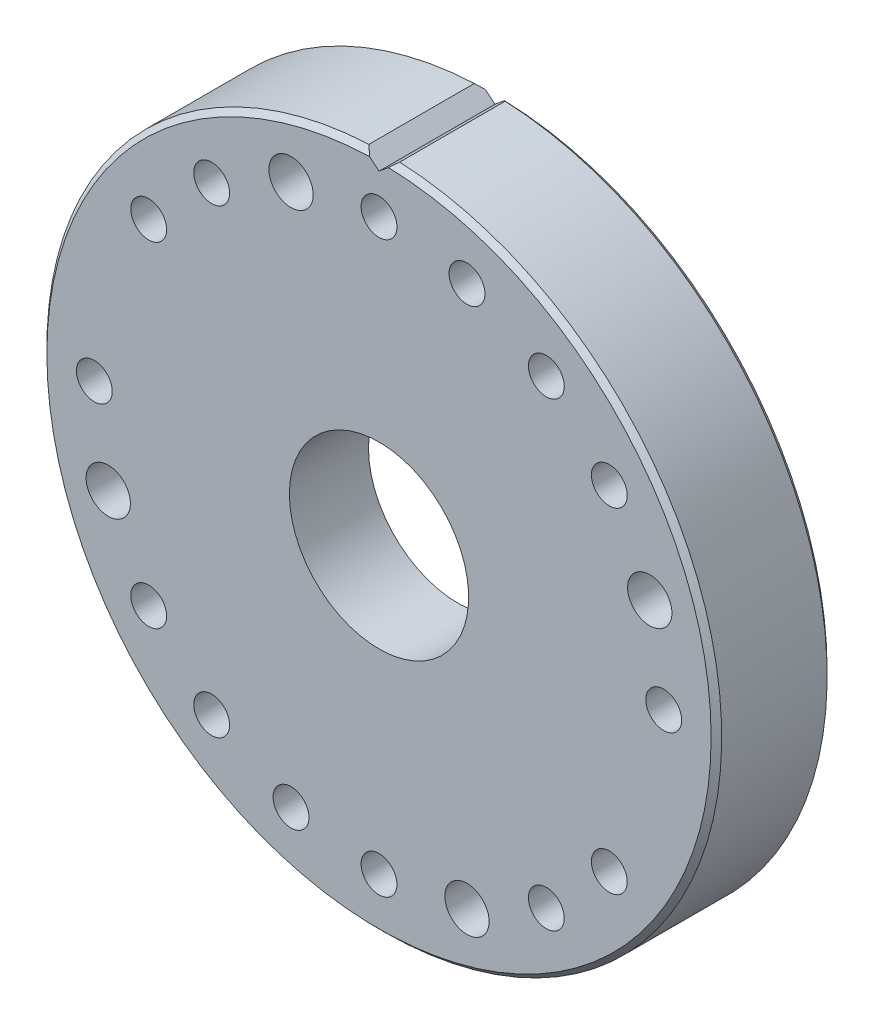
ISO-10303-21;
HEADER;
FILE_DESCRIPTION(('STEP AP214'),'2;1');
FILE_NAME('part.step','',(''),(''),'','','');
FILE_SCHEMA(('AUTOMOTIVE_DESIGN { 1 0 10303 214 1 1 1 1 }'));
ENDSEC;
DATA;
#1=APPLICATION_CONTEXT('core data for automotive mechanical design processes');
#2=APPLICATION_PROTOCOL_DEFINITION('international standard','automotive_design',2000,#1);
#3=PRODUCT_CONTEXT('',#1,'mechanical');
#4=PRODUCT('Part','Part','',(#3));
#5=PRODUCT_RELATED_PRODUCT_CATEGORY('part','',(#4));
#6=PRODUCT_DEFINITION_FORMATION('','',#4);
#7=PRODUCT_DEFINITION_CONTEXT('part definition',#1,'design');
#8=PRODUCT_DEFINITION('design','',#6,#7);
#9=PRODUCT_DEFINITION_SHAPE('','',#8);
#10=(LENGTH_UNIT() NAMED_UNIT(*) SI_UNIT(.MILLI.,.METRE.));
#11=(NAMED_UNIT(*) PLANE_ANGLE_UNIT() SI_UNIT($,.RADIAN.));
#12=(NAMED_UNIT(*) SI_UNIT($,.STERADIAN.) SOLID_ANGLE_UNIT());
#13=UNCERTAINTY_MEASURE_WITH_UNIT(LENGTH_MEASURE(1.E-05),#10,'distance_accuracy_value','');
#14=(GEOMETRIC_REPRESENTATION_CONTEXT(3) GLOBAL_UNCERTAINTY_ASSIGNED_CONTEXT((#13)) GLOBAL_UNIT_ASSIGNED_CONTEXT((#10,
#11,#12)) REPRESENTATION_CONTEXT('',''));
#15=CARTESIAN_POINT('',(0.,0.,0.));
#16=DIRECTION('',(0.,0.,1.));
#17=DIRECTION('',(1.,0.,0.));
#18=AXIS2_PLACEMENT_3D('',#15,#16,#17);
#19=CARTESIAN_POINT('',(0.,0.,14.5));
#20=DIRECTION('',(0.,0.,1.));
#21=DIRECTION('',(1.,0.,0.));
#22=AXIS2_PLACEMENT_3D('',#19,#20,#21);
#23=CYLINDRICAL_SURFACE('',#22,8.5);
#24=CARTESIAN_POINT('',(0.,0.,-32.));
#25=DIRECTION('',(0.,0.,-1.));
#26=DIRECTION('',(-1.,0.,0.));
#27=AXIS2_PLACEMENT_3D('',#24,#25,#26);
#28=CIRCLE('',#27,8.5);
#29=CARTESIAN_POINT('',(-8.5,0.,-32.));
#30=VERTEX_POINT('',#29);
#31=EDGE_CURVE('E495',#30,#30,#28,.F.);
#32=ORIENTED_EDGE('',*,*,#31,.T.);
#33=EDGE_LOOP('',(#32));
#34=FACE_BOUND('',#33,.T.);
#35=CARTESIAN_POINT('',(0.,0.,-39.5));
#36=DIRECTION('',(0.,0.,-1.));
#37=DIRECTION('',(-1.,0.,0.));
#38=AXIS2_PLACEMENT_3D('',#35,#36,#37);
#39=CIRCLE('',#38,8.5);
#40=CARTESIAN_POINT('',(-8.5,0.,-39.5));
#41=VERTEX_POINT('',#40);
#42=EDGE_CURVE('E498',#41,#41,#39,.F.);
#43=ORIENTED_EDGE('',*,*,#42,.F.);
#44=EDGE_LOOP('',(#43));
#45=FACE_BOUND('',#44,.T.);
#46=ADVANCED_FACE('F16',(#34,#45),#23,.F.);
#47=CARTESIAN_POINT('',(0.,0.,-32.));
#48=DIRECTION('',(0.,0.,-1.));
#49=DIRECTION('',(-1.,0.,0.));
#50=AXIS2_PLACEMENT_3D('',#47,#48,#49);
#51=PLANE('',#50);
#52=ORIENTED_EDGE('',*,*,#31,.F.);
#53=EDGE_LOOP('',(#52));
#54=FACE_BOUND('',#53,.T.);
#55=CARTESIAN_POINT('',(-15.8702018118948,21.8434588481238,-32.00000000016));
#56=DIRECTION('',(0.,0.,-1.));
#57=DIRECTION('',(-1.,0.,0.));
#58=AXIS2_PLACEMENT_3D('',#55,#56,#57);
#59=CIRCLE('',#58,1.7);
#60=CARTESIAN_POINT('',(-17.5702018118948,21.8434588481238,-32.));
#61=VERTEX_POINT('',#60);
#62=CARTESIAN_POINT('',(-14.1702018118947,21.8434588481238,-32.000000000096));
#63=VERTEX_POINT('',#62);
#64=EDGE_CURVE('E489',#61,#63,#59,.T.);
#65=ORIENTED_EDGE('',*,*,#64,.T.);
#66=CARTESIAN_POINT('',(-15.8702018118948,21.8434588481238,-32.00000000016));
#67=DIRECTION('',(0.,0.,-1.));
#68=DIRECTION('',(-1.,0.,0.));
#69=AXIS2_PLACEMENT_3D('',#66,#67,#68);
#70=CIRCLE('',#69,1.7);
#71=EDGE_CURVE('E20',#63,#61,#70,.T.);
#72=ORIENTED_EDGE('',*,*,#71,.T.);
#73=EDGE_LOOP('',(#65,#72));
#74=FACE_BOUND('',#73,.T.);
#75=CARTESIAN_POINT('',(-21.8434588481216,15.8702018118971,-32.00000000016));
#76=DIRECTION('',(0.,0.,-1.));
#77=DIRECTION('',(-1.,0.,0.));
#78=AXIS2_PLACEMENT_3D('',#75,#76,#77);
#79=CIRCLE('',#78,1.7);
#80=CARTESIAN_POINT('',(-23.5434588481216,15.8702018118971,-32.));
#81=VERTEX_POINT('',#80);
#82=CARTESIAN_POINT('',(-20.1434588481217,15.8702018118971,-32.000000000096));
#83=VERTEX_POINT('',#82);
#84=EDGE_CURVE('E485',#81,#83,#79,.T.);
#85=ORIENTED_EDGE('',*,*,#84,.T.);
#86=CARTESIAN_POINT('',(-21.8434588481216,15.8702018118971,-32.00000000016));
#87=DIRECTION('',(0.,0.,-1.));
#88=DIRECTION('',(-1.,0.,0.));
#89=AXIS2_PLACEMENT_3D('',#86,#87,#88);
#90=CIRCLE('',#89,1.7);
#91=EDGE_CURVE('E487',#83,#81,#90,.T.);
#92=ORIENTED_EDGE('',*,*,#91,.T.);
#93=EDGE_LOOP('',(#85,#92));
#94=FACE_BOUND('',#93,.T.);
#95=CARTESIAN_POINT('',(-26.9999999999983,2.84769423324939E-13,-32.00000000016));
#96=DIRECTION('',(0.,0.,-1.));
#97=DIRECTION('',(-1.,0.,0.));
#98=AXIS2_PLACEMENT_3D('',#95,#96,#97);
#99=CIRCLE('',#98,1.7);
#100=CARTESIAN_POINT('',(-28.6999999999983,2.84769423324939E-13,-32.));
#101=VERTEX_POINT('',#100);
#102=CARTESIAN_POINT('',(-25.2999999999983,2.84977613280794E-13,-32.000000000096));
#103=VERTEX_POINT('',#102);
#104=EDGE_CURVE('E480',#101,#103,#99,.T.);
#105=ORIENTED_EDGE('',*,*,#104,.T.);
#106=CARTESIAN_POINT('',(-26.9999999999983,2.84769423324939E-13,-32.00000000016));
#107=DIRECTION('',(0.,0.,-1.));
#108=DIRECTION('',(-1.,0.,0.));
#109=AXIS2_PLACEMENT_3D('',#106,#107,#108);
#110=CIRCLE('',#109,1.7);
#111=EDGE_CURVE('E482',#103,#101,#110,.T.);
#112=ORIENTED_EDGE('',*,*,#111,.T.);
#113=EDGE_LOOP('',(#105,#112));
#114=FACE_BOUND('',#113,.T.);
#115=CARTESIAN_POINT('',(-15.8702018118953,-21.8434588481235,-32.00000000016));
#116=DIRECTION('',(0.,0.,-1.));
#117=DIRECTION('',(-1.,0.,0.));
#118=AXIS2_PLACEMENT_3D('',#115,#116,#117);
#119=CIRCLE('',#118,1.7);
#120=CARTESIAN_POINT('',(-17.5702018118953,-21.8434588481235,-32.));
#121=VERTEX_POINT('',#120);
#122=CARTESIAN_POINT('',(-14.1702018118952,-21.8434588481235,-32.000000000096));
#123=VERTEX_POINT('',#122);
#124=EDGE_CURVE('E475',#121,#123,#119,.T.);
#125=ORIENTED_EDGE('',*,*,#124,.T.);
#126=CARTESIAN_POINT('',(-15.8702018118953,-21.8434588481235,-32.00000000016));
#127=DIRECTION('',(0.,0.,-1.));
#128=DIRECTION('',(-1.,0.,0.));
#129=AXIS2_PLACEMENT_3D('',#126,#127,#128);
#130=CIRCLE('',#129,1.7);
#131=EDGE_CURVE('E477',#123,#121,#130,.T.);
#132=ORIENTED_EDGE('',*,*,#131,.T.);
#133=EDGE_LOOP('',(#125,#132));
#134=FACE_BOUND('',#133,.T.);
#135=CARTESIAN_POINT('',(-8.34345884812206,-25.6785259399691,-32.00000000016));
#136=DIRECTION('',(0.,0.,-1.));
#137=DIRECTION('',(-1.,0.,0.));
#138=AXIS2_PLACEMENT_3D('',#135,#136,#137);
#139=CIRCLE('',#138,1.7);
#140=CARTESIAN_POINT('',(-10.0434588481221,-25.6785259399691,-32.));
#141=VERTEX_POINT('',#140);
#142=CARTESIAN_POINT('',(-6.64345884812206,-25.6785259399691,-32.000000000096));
#143=VERTEX_POINT('',#142);
#144=EDGE_CURVE('E470',#141,#143,#139,.T.);
#145=ORIENTED_EDGE('',*,*,#144,.T.);
#146=CARTESIAN_POINT('',(-8.34345884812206,-25.6785259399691,-32.00000000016));
#147=DIRECTION('',(0.,0.,-1.));
#148=DIRECTION('',(-1.,0.,0.));
#149=AXIS2_PLACEMENT_3D('',#146,#147,#148);
#150=CIRCLE('',#149,1.7);
#151=EDGE_CURVE('E472',#143,#141,#150,.T.);
#152=ORIENTED_EDGE('',*,*,#151,.T.);
#153=EDGE_LOOP('',(#145,#152));
#154=FACE_BOUND('',#153,.T.);
#155=CARTESIAN_POINT('',(1.72455539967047E-12,-27.,-32.00000000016));
#156=DIRECTION('',(0.,0.,-1.));
#157=DIRECTION('',(-1.,0.,0.));
#158=AXIS2_PLACEMENT_3D('',#155,#156,#157);
#159=CIRCLE('',#158,1.7);
#160=CARTESIAN_POINT('',(-1.69999999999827,-27.,-32.));
#161=VERTEX_POINT('',#160);
#162=CARTESIAN_POINT('',(1.70000000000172,-27.,-32.000000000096));
#163=VERTEX_POINT('',#162);
#164=EDGE_CURVE('E465',#161,#163,#159,.T.);
#165=ORIENTED_EDGE('',*,*,#164,.T.);
#166=CARTESIAN_POINT('',(1.72455539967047E-12,-27.,-32.00000000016));
#167=DIRECTION('',(0.,0.,-1.));
#168=DIRECTION('',(-1.,0.,0.));
#169=AXIS2_PLACEMENT_3D('',#166,#167,#168);
#170=CIRCLE('',#169,1.7);
#171=EDGE_CURVE('E467',#163,#161,#170,.T.);
#172=ORIENTED_EDGE('',*,*,#171,.T.);
#173=EDGE_LOOP('',(#165,#172));
#174=FACE_BOUND('',#173,.T.);
#175=CARTESIAN_POINT('',(15.8702018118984,-21.8434588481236,-32.00000000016));
#176=DIRECTION('',(0.,0.,-1.));
#177=DIRECTION('',(-1.,0.,0.));
#178=AXIS2_PLACEMENT_3D('',#175,#176,#177);
#179=CIRCLE('',#178,1.7);
#180=CARTESIAN_POINT('',(14.1702018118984,-21.8434588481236,-32.));
#181=VERTEX_POINT('',#180);
#182=CARTESIAN_POINT('',(17.5702018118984,-21.8434588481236,-32.000000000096));
#183=VERTEX_POINT('',#182);
#184=EDGE_CURVE('E460',#181,#183,#179,.T.);
#185=ORIENTED_EDGE('',*,*,#184,.T.);
#186=CARTESIAN_POINT('',(15.8702018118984,-21.8434588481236,-32.00000000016));
#187=DIRECTION('',(0.,0.,-1.));
#188=DIRECTION('',(-1.,0.,0.));
#189=AXIS2_PLACEMENT_3D('',#186,#187,#188);
#190=CIRCLE('',#189,1.7);
#191=EDGE_CURVE('E462',#183,#181,#190,.T.);
#192=ORIENTED_EDGE('',*,*,#191,.T.);
#193=EDGE_LOOP('',(#185,#192));
#194=FACE_BOUND('',#193,.T.);
#195=CARTESIAN_POINT('',(21.8434588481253,-15.8702018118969,-32.00000000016));
#196=DIRECTION('',(0.,0.,-1.));
#197=DIRECTION('',(-1.,0.,0.));
#198=AXIS2_PLACEMENT_3D('',#195,#196,#197);
#199=CIRCLE('',#198,1.7);
#200=CARTESIAN_POINT('',(20.1434588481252,-15.8702018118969,-32.));
#201=VERTEX_POINT('',#200);
#202=CARTESIAN_POINT('',(23.5434588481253,-15.8702018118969,-32.000000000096));
#203=VERTEX_POINT('',#202);
#204=EDGE_CURVE('E455',#201,#203,#199,.T.);
#205=ORIENTED_EDGE('',*,*,#204,.T.);
#206=CARTESIAN_POINT('',(21.8434588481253,-15.8702018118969,-32.00000000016));
#207=DIRECTION('',(0.,0.,-1.));
#208=DIRECTION('',(-1.,0.,0.));
#209=AXIS2_PLACEMENT_3D('',#206,#207,#208);
#210=CIRCLE('',#209,1.7);
#211=EDGE_CURVE('E457',#203,#201,#210,.T.);
#212=ORIENTED_EDGE('',*,*,#211,.T.);
#213=EDGE_LOOP('',(#205,#212));
#214=FACE_BOUND('',#213,.T.);
#215=CARTESIAN_POINT('',(27.0000000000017,0.,-32.00000000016));
#216=DIRECTION('',(0.,0.,-1.));
#217=DIRECTION('',(-1.,0.,0.));
#218=AXIS2_PLACEMENT_3D('',#215,#216,#217);
#219=CIRCLE('',#218,1.7);
#220=CARTESIAN_POINT('',(25.3000000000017,0.,-32.));
#221=VERTEX_POINT('',#220);
#222=CARTESIAN_POINT('',(28.7000000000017,0.,-32.000000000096));
#223=VERTEX_POINT('',#222);
#224=EDGE_CURVE('E450',#221,#223,#219,.T.);
#225=ORIENTED_EDGE('',*,*,#224,.T.);
#226=CARTESIAN_POINT('',(27.0000000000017,0.,-32.00000000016));
#227=DIRECTION('',(0.,0.,-1.));
#228=DIRECTION('',(-1.,0.,0.));
#229=AXIS2_PLACEMENT_3D('',#226,#227,#228);
#230=CIRCLE('',#229,1.7);
#231=EDGE_CURVE('E452',#223,#221,#230,.T.);
#232=ORIENTED_EDGE('',*,*,#231,.T.);
#233=EDGE_LOOP('',(#225,#232));
#234=FACE_BOUND('',#233,.T.);
#235=CARTESIAN_POINT('',(21.8434588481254,15.8702018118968,-32.00000000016));
#236=DIRECTION('',(0.,0.,-1.));
#237=DIRECTION('',(-1.,0.,0.));
#238=AXIS2_PLACEMENT_3D('',#235,#236,#237);
#239=CIRCLE('',#238,1.7);
#240=CARTESIAN_POINT('',(20.1434588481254,15.8702018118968,-32.));
#241=VERTEX_POINT('',#240);
#242=CARTESIAN_POINT('',(23.5434588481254,15.8702018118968,-32.000000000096));
#243=VERTEX_POINT('',#242);
#244=EDGE_CURVE('E445',#241,#243,#239,.T.);
#245=ORIENTED_EDGE('',*,*,#244,.T.);
#246=CARTESIAN_POINT('',(21.8434588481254,15.8702018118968,-32.00000000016));
#247=DIRECTION('',(0.,0.,-1.));
#248=DIRECTION('',(-1.,0.,0.));
#249=AXIS2_PLACEMENT_3D('',#246,#247,#248);
#250=CIRCLE('',#249,1.7);
#251=EDGE_CURVE('E447',#243,#241,#250,.T.);
#252=ORIENTED_EDGE('',*,*,#251,.T.);
#253=EDGE_LOOP('',(#245,#252));
#254=FACE_BOUND('',#253,.T.);
#255=CARTESIAN_POINT('',(15.8702018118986,21.8434588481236,-32.00000000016));
#256=DIRECTION('',(0.,0.,-1.));
#257=DIRECTION('',(-1.,0.,0.));
#258=AXIS2_PLACEMENT_3D('',#255,#256,#257);
#259=CIRCLE('',#258,1.7);
#260=CARTESIAN_POINT('',(14.1702018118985,21.8434588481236,-32.));
#261=VERTEX_POINT('',#260);
#262=CARTESIAN_POINT('',(17.5702018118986,21.8434588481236,-32.000000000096));
#263=VERTEX_POINT('',#262);
#264=EDGE_CURVE('E440',#261,#263,#259,.T.);
#265=ORIENTED_EDGE('',*,*,#264,.T.);
#266=CARTESIAN_POINT('',(15.8702018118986,21.8434588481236,-32.00000000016));
#267=DIRECTION('',(0.,0.,-1.));
#268=DIRECTION('',(-1.,0.,0.));
#269=AXIS2_PLACEMENT_3D('',#266,#267,#268);
#270=CIRCLE('',#269,1.7);
#271=EDGE_CURVE('E442',#263,#261,#270,.T.);
#272=ORIENTED_EDGE('',*,*,#271,.T.);
#273=EDGE_LOOP('',(#265,#272));
#274=FACE_BOUND('',#273,.T.);
#275=CARTESIAN_POINT('',(8.34345884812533,25.6785259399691,-32.00000000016));
#276=DIRECTION('',(0.,0.,-1.));
#277=DIRECTION('',(-1.,0.,0.));
#278=AXIS2_PLACEMENT_3D('',#275,#276,#277);
#279=CIRCLE('',#278,1.7);
#280=CARTESIAN_POINT('',(6.64345884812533,25.6785259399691,-32.));
#281=VERTEX_POINT('',#280);
#282=CARTESIAN_POINT('',(10.0434588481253,25.6785259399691,-32.000000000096));
#283=VERTEX_POINT('',#282);
#284=EDGE_CURVE('E435',#281,#283,#279,.T.);
#285=ORIENTED_EDGE('',*,*,#284,.T.);
#286=CARTESIAN_POINT('',(8.34345884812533,25.6785259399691,-32.00000000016));
#287=DIRECTION('',(0.,0.,-1.));
#288=DIRECTION('',(-1.,0.,0.));
#289=AXIS2_PLACEMENT_3D('',#286,#287,#288);
#290=CIRCLE('',#289,1.7);
#291=EDGE_CURVE('E437',#283,#281,#290,.T.);
#292=ORIENTED_EDGE('',*,*,#291,.T.);
#293=EDGE_LOOP('',(#285,#292));
#294=FACE_BOUND('',#293,.T.);
#295=CARTESIAN_POINT('',(1.72455539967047E-12,27.,-32.00000000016));
#296=DIRECTION('',(0.,0.,-1.));
#297=DIRECTION('',(-1.,0.,0.));
#298=AXIS2_PLACEMENT_3D('',#295,#296,#297);
#299=CIRCLE('',#298,1.7);
#300=CARTESIAN_POINT('',(-1.69999999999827,27.,-32.));
#301=VERTEX_POINT('',#300);
#302=CARTESIAN_POINT('',(1.70000000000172,27.,-32.000000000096));
#303=VERTEX_POINT('',#302);
#304=EDGE_CURVE('E430',#301,#303,#299,.T.);
#305=ORIENTED_EDGE('',*,*,#304,.T.);
#306=CARTESIAN_POINT('',(1.72455539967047E-12,27.,-32.00000000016));
#307=DIRECTION('',(0.,0.,-1.));
#308=DIRECTION('',(-1.,0.,0.));
#309=AXIS2_PLACEMENT_3D('',#306,#307,#308);
#310=CIRCLE('',#309,1.7);
#311=EDGE_CURVE('E432',#303,#301,#310,.T.);
#312=ORIENTED_EDGE('',*,*,#311,.T.);
#313=EDGE_LOOP('',(#305,#312));
#314=FACE_BOUND('',#313,.T.);
#315=CARTESIAN_POINT('',(-21.843458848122,-15.8702018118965,-32.00000000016));
#316=DIRECTION('',(0.,0.,-1.));
#317=DIRECTION('',(-1.,0.,0.));
#318=AXIS2_PLACEMENT_3D('',#315,#316,#317);
#319=CIRCLE('',#318,1.7);
#320=CARTESIAN_POINT('',(-23.543458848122,-15.8702018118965,-32.));
#321=VERTEX_POINT('',#320);
#322=CARTESIAN_POINT('',(-20.143458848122,-15.8702018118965,-32.000000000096));
#323=VERTEX_POINT('',#322);
#324=EDGE_CURVE('E422',#321,#323,#319,.T.);
#325=ORIENTED_EDGE('',*,*,#324,.T.);
#326=CARTESIAN_POINT('',(-21.843458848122,-15.8702018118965,-32.00000000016));
#327=DIRECTION('',(0.,0.,-1.));
#328=DIRECTION('',(-1.,0.,0.));
#329=AXIS2_PLACEMENT_3D('',#326,#327,#328);
#330=CIRCLE('',#329,1.7);
#331=EDGE_CURVE('E424',#323,#321,#330,.T.);
#332=ORIENTED_EDGE('',*,*,#331,.T.);
#333=EDGE_LOOP('',(#325,#332));
#334=FACE_BOUND('',#333,.T.);
#335=CARTESIAN_POINT('',(25.6785259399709,8.34345884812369,-32.00000000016));
#336=DIRECTION('',(0.,0.,-1.));
#337=DIRECTION('',(-1.,0.,0.));
#338=AXIS2_PLACEMENT_3D('',#335,#336,#337);
#339=CIRCLE('',#338,2.1);
#340=CARTESIAN_POINT('',(23.5785259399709,8.34345884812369,-32.));
#341=VERTEX_POINT('',#340);
#342=CARTESIAN_POINT('',(27.7785259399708,8.34345884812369,-32.000000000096));
#343=VERTEX_POINT('',#342);
#344=EDGE_CURVE('E720',#341,#343,#339,.T.);
#345=ORIENTED_EDGE('',*,*,#344,.T.);
#346=CARTESIAN_POINT('',(25.6785259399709,8.34345884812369,-32.00000000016));
#347=DIRECTION('',(0.,0.,-1.));
#348=DIRECTION('',(-1.,0.,0.));
#349=AXIS2_PLACEMENT_3D('',#346,#347,#348);
#350=CIRCLE('',#349,2.1);
#351=EDGE_CURVE('E722',#343,#341,#350,.T.);
#352=ORIENTED_EDGE('',*,*,#351,.T.);
#353=EDGE_LOOP('',(#345,#352));
#354=FACE_BOUND('',#353,.T.);
#355=CARTESIAN_POINT('',(8.34345884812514,-25.6785259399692,-32.00000000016));
#356=DIRECTION('',(0.,0.,-1.));
#357=DIRECTION('',(-1.,0.,0.));
#358=AXIS2_PLACEMENT_3D('',#355,#356,#357);
#359=CIRCLE('',#358,2.1);
#360=CARTESIAN_POINT('',(6.24345884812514,-25.6785259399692,-32.));
#361=VERTEX_POINT('',#360);
#362=CARTESIAN_POINT('',(10.4434588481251,-25.6785259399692,-32.000000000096));
#363=VERTEX_POINT('',#362);
#364=EDGE_CURVE('E715',#361,#363,#359,.T.);
#365=ORIENTED_EDGE('',*,*,#364,.T.);
#366=CARTESIAN_POINT('',(8.34345884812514,-25.6785259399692,-32.00000000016));
#367=DIRECTION('',(0.,0.,-1.));
#368=DIRECTION('',(-1.,0.,0.));
#369=AXIS2_PLACEMENT_3D('',#366,#367,#368);
#370=CIRCLE('',#369,2.1);
#371=EDGE_CURVE('E717',#363,#361,#370,.T.);
#372=ORIENTED_EDGE('',*,*,#371,.T.);
#373=EDGE_LOOP('',(#365,#372));
#374=FACE_BOUND('',#373,.T.);
#375=CARTESIAN_POINT('',(-25.6785259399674,-8.3434588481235,-32.00000000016));
#376=DIRECTION('',(0.,0.,-1.));
#377=DIRECTION('',(-1.,0.,0.));
#378=AXIS2_PLACEMENT_3D('',#375,#376,#377);
#379=CIRCLE('',#378,2.1);
#380=CARTESIAN_POINT('',(-27.7785259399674,-8.3434588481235,-32.));
#381=VERTEX_POINT('',#380);
#382=CARTESIAN_POINT('',(-23.5785259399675,-8.3434588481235,-32.000000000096));
#383=VERTEX_POINT('',#382);
#384=EDGE_CURVE('E709',#381,#383,#379,.T.);
#385=ORIENTED_EDGE('',*,*,#384,.T.);
#386=CARTESIAN_POINT('',(-25.6785259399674,-8.3434588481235,-32.00000000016));
#387=DIRECTION('',(0.,0.,-1.));
#388=DIRECTION('',(-1.,0.,0.));
#389=AXIS2_PLACEMENT_3D('',#386,#387,#388);
#390=CIRCLE('',#389,2.1);
#391=EDGE_CURVE('E712',#383,#381,#390,.T.);
#392=ORIENTED_EDGE('',*,*,#391,.T.);
#393=EDGE_LOOP('',(#385,#392));
#394=FACE_BOUND('',#393,.T.);
#395=CARTESIAN_POINT('',(-8.34345884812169,25.6785259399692,-32.00000000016));
#396=DIRECTION('',(0.,0.,-1.));
#397=DIRECTION('',(-1.,0.,0.));
#398=AXIS2_PLACEMENT_3D('',#395,#396,#397);
#399=CIRCLE('',#398,2.1);
#400=CARTESIAN_POINT('',(-10.4434588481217,25.6785259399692,-32.));
#401=VERTEX_POINT('',#400);
#402=CARTESIAN_POINT('',(-6.24345884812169,25.6785259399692,-32.000000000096));
#403=VERTEX_POINT('',#402);
#404=EDGE_CURVE('E703',#401,#403,#399,.T.);
#405=ORIENTED_EDGE('',*,*,#404,.T.);
#406=CARTESIAN_POINT('',(-8.34345884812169,25.6785259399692,-32.00000000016));
#407=DIRECTION('',(0.,0.,-1.));
#408=DIRECTION('',(-1.,0.,0.));
#409=AXIS2_PLACEMENT_3D('',#406,#407,#408);
#410=CIRCLE('',#409,2.1);
#411=EDGE_CURVE('E705',#403,#401,#410,.T.);
#412=ORIENTED_EDGE('',*,*,#411,.T.);
#413=EDGE_LOOP('',(#405,#412));
#414=FACE_BOUND('',#413,.T.);
#415=DIRECTION('',(0.766044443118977,-0.64278760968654,0.));
#416=VECTOR('',#415,1.);
#417=CARTESIAN_POINT('',(1.72455539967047E-12,30.7413505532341,-32.));
#418=LINE('',#417,#416);
#419=CARTESIAN_POINT('',(1.73482485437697E-12,30.7413505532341,-32.));
#420=VERTEX_POINT('',#419);
#421=CARTESIAN_POINT('',(-0.889164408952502,31.4874480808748,-32.000000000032));
#422=VERTEX_POINT('',#421);
#423=EDGE_CURVE('E524',#420,#422,#418,.F.);
#424=ORIENTED_EDGE('',*,*,#423,.T.);
#425=CARTESIAN_POINT('',(1.72431513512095E-12,0.,-32.00000000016));
#426=DIRECTION('',(0.,0.,-1.));
#427=DIRECTION('',(-1.,0.,0.));
#428=AXIS2_PLACEMENT_3D('',#425,#426,#427);
#429=CIRCLE('',#428,31.5);
#430=CARTESIAN_POINT('',(-31.4999999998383,0.,-32.));
#431=VERTEX_POINT('',#430);
#432=EDGE_CURVE('E510',#422,#431,#429,.F.);
#433=ORIENTED_EDGE('',*,*,#432,.T.);
#434=CARTESIAN_POINT('',(1.72431513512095E-12,0.,-32.00000000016));
#435=DIRECTION('',(0.,0.,-1.));
#436=DIRECTION('',(-1.,0.,0.));
#437=AXIS2_PLACEMENT_3D('',#434,#435,#436);
#438=CIRCLE('',#437,31.5);
#439=CARTESIAN_POINT('',(31.4999999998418,0.,-32.));
#440=VERTEX_POINT('',#439);
#441=EDGE_CURVE('E26',#431,#440,#438,.F.);
#442=ORIENTED_EDGE('',*,*,#441,.T.);
#443=CARTESIAN_POINT('',(1.72431513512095E-12,0.,-32.00000000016));
#444=DIRECTION('',(0.,0.,-1.));
#445=DIRECTION('',(-1.,0.,0.));
#446=AXIS2_PLACEMENT_3D('',#443,#444,#445);
#447=CIRCLE('',#446,31.5);
#448=CARTESIAN_POINT('',(0.889164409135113,31.4874480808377,-32.));
#449=VERTEX_POINT('',#448);
#450=EDGE_CURVE('E10',#440,#449,#447,.F.);
#451=ORIENTED_EDGE('',*,*,#450,.T.);
#452=DIRECTION('',(0.766044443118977,0.64278760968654,0.));
#453=VECTOR('',#452,1.);
#454=CARTESIAN_POINT('',(1.50000000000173,32.,-32.00000000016));
#455=LINE('',#454,#453);
#456=EDGE_CURVE('E517',#449,#420,#455,.F.);
#457=ORIENTED_EDGE('',*,*,#456,.T.);
#458=EDGE_LOOP('',(#424,#433,#442,#451,#457));
#459=FACE_BOUND('',#458,.T.);
#460=ADVANCED_FACE('F894',(#54,#74,#94,#114,#134,#154,#174,#194,#214,#234,#254,#274,#294,#314,
#334,#354,#374,#394,#414,#459),#51,.F.);
#461=CARTESIAN_POINT('',(-15.8702018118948,21.8434588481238,-43.00000000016));
#462=DIRECTION('',(0.,0.,-1.));
#463=DIRECTION('',(-1.,0.,0.));
#464=AXIS2_PLACEMENT_3D('',#461,#462,#463);
#465=CYLINDRICAL_SURFACE('',#464,1.7);
#466=ORIENTED_EDGE('',*,*,#64,.F.);
#467=ORIENTED_EDGE('',*,*,#71,.F.);
#468=EDGE_LOOP('',(#466,#467));
#469=FACE_BOUND('',#468,.T.);
#470=CARTESIAN_POINT('',(-15.8702018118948,21.8434588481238,-39.60000000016));
#471=DIRECTION('',(0.,0.,-1.));
#472=DIRECTION('',(-1.,0.,0.));
#473=AXIS2_PLACEMENT_3D('',#470,#471,#472);
#474=CIRCLE('',#473,1.7);
#475=CARTESIAN_POINT('',(-14.1702018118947,21.8434588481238,-39.60000000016));
#476=VERTEX_POINT('',#475);
#477=CARTESIAN_POINT('',(-17.5702018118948,21.8434588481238,-39.60000000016));
#478=VERTEX_POINT('',#477);
#479=EDGE_CURVE('E418',#476,#478,#474,.T.);
#480=ORIENTED_EDGE('',*,*,#479,.T.);
#481=CARTESIAN_POINT('',(-15.8702018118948,21.8434588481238,-39.60000000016));
#482=DIRECTION('',(0.,0.,-1.));
#483=DIRECTION('',(-1.,0.,0.));
#484=AXIS2_PLACEMENT_3D('',#481,#482,#483);
#485=CIRCLE('',#484,1.7);
#486=EDGE_CURVE('E415',#478,#476,#485,.T.);
#487=ORIENTED_EDGE('',*,*,#486,.T.);
#488=EDGE_LOOP('',(#480,#487));
#489=FACE_BOUND('',#488,.T.);
#490=ADVANCED_FACE('F18',(#469,#489),#465,.F.);
#491=CARTESIAN_POINT('',(-21.8434588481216,15.8702018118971,-43.00000000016));
#492=DIRECTION('',(0.,0.,-1.));
#493=DIRECTION('',(-1.,0.,0.));
#494=AXIS2_PLACEMENT_3D('',#491,#492,#493);
#495=CYLINDRICAL_SURFACE('',#494,1.7);
#496=ORIENTED_EDGE('',*,*,#84,.F.);
#497=ORIENTED_EDGE('',*,*,#91,.F.);
#498=EDGE_LOOP('',(#496,#497));
#499=FACE_BOUND('',#498,.T.);
#500=CARTESIAN_POINT('',(-21.8434588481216,15.8702018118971,-39.60000000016));
#501=DIRECTION('',(0.,0.,-1.));
#502=DIRECTION('',(-1.,0.,0.));
#503=AXIS2_PLACEMENT_3D('',#500,#501,#502);
#504=CIRCLE('',#503,1.7);
#505=CARTESIAN_POINT('',(-20.1434588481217,15.8702018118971,-39.60000000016));
#506=VERTEX_POINT('',#505);
#507=CARTESIAN_POINT('',(-23.5434588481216,15.8702018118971,-39.60000000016));
#508=VERTEX_POINT('',#507);
#509=EDGE_CURVE('E420',#506,#508,#504,.T.);
#510=ORIENTED_EDGE('',*,*,#509,.T.);
#511=CARTESIAN_POINT('',(-21.8434588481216,15.8702018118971,-39.60000000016));
#512=DIRECTION('',(0.,0.,-1.));
#513=DIRECTION('',(-1.,0.,0.));
#514=AXIS2_PLACEMENT_3D('',#511,#512,#513);
#515=CIRCLE('',#514,1.7);
#516=EDGE_CURVE('E871',#508,#506,#515,.T.);
#517=ORIENTED_EDGE('',*,*,#516,.T.);
#518=EDGE_LOOP('',(#510,#517));
#519=FACE_BOUND('',#518,.T.);
#520=ADVANCED_FACE('F875',(#499,#519),#495,.F.);
#521=CARTESIAN_POINT('',(-26.9999999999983,2.84769423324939E-13,-43.00000000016));
#522=DIRECTION('',(0.,0.,-1.));
#523=DIRECTION('',(-1.,0.,0.));
#524=AXIS2_PLACEMENT_3D('',#521,#522,#523);
#525=CYLINDRICAL_SURFACE('',#524,1.7);
#526=ORIENTED_EDGE('',*,*,#104,.F.);
#527=ORIENTED_EDGE('',*,*,#111,.F.);
#528=EDGE_LOOP('',(#526,#527));
#529=FACE_BOUND('',#528,.T.);
#530=CARTESIAN_POINT('',(-26.9999999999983,2.84769423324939E-13,-39.60000000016));
#531=DIRECTION('',(0.,0.,-1.));
#532=DIRECTION('',(-1.,0.,0.));
#533=AXIS2_PLACEMENT_3D('',#530,#531,#532);
#534=CIRCLE('',#533,1.7);
#535=CARTESIAN_POINT('',(-25.2999999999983,2.84977613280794E-13,-39.60000000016));
#536=VERTEX_POINT('',#535);
#537=CARTESIAN_POINT('',(-28.6999999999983,2.84686147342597E-13,-39.60000000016));
#538=VERTEX_POINT('',#537);
#539=EDGE_CURVE('E868',#536,#538,#534,.T.);
#540=ORIENTED_EDGE('',*,*,#539,.T.);
#541=CARTESIAN_POINT('',(-26.9999999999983,2.84769423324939E-13,-39.60000000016));
#542=DIRECTION('',(0.,0.,-1.));
#543=DIRECTION('',(-1.,0.,0.));
#544=AXIS2_PLACEMENT_3D('',#541,#542,#543);
#545=CIRCLE('',#544,1.7);
#546=EDGE_CURVE('E865',#538,#536,#545,.T.);
#547=ORIENTED_EDGE('',*,*,#546,.T.);
#548=EDGE_LOOP('',(#540,#547));
#549=FACE_BOUND('',#548,.T.);
#550=ADVANCED_FACE('F1212',(#529,#549),#525,.F.);
#551=CARTESIAN_POINT('',(-15.8702018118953,-21.8434588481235,-43.00000000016));
#552=DIRECTION('',(0.,0.,-1.));
#553=DIRECTION('',(-1.,0.,0.));
#554=AXIS2_PLACEMENT_3D('',#551,#552,#553);
#555=CYLINDRICAL_SURFACE('',#554,1.7);
#556=ORIENTED_EDGE('',*,*,#124,.F.);
#557=ORIENTED_EDGE('',*,*,#131,.F.);
#558=EDGE_LOOP('',(#556,#557));
#559=FACE_BOUND('',#558,.T.);
#560=CARTESIAN_POINT('',(-15.8702018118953,-21.8434588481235,-39.60000000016));
#561=DIRECTION('',(0.,0.,-1.));
#562=DIRECTION('',(-1.,0.,0.));
#563=AXIS2_PLACEMENT_3D('',#560,#561,#562);
#564=CIRCLE('',#563,1.7);
#565=CARTESIAN_POINT('',(-14.1702018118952,-21.8434588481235,-39.60000000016));
#566=VERTEX_POINT('',#565);
#567=CARTESIAN_POINT('',(-17.5702018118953,-21.8434588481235,-39.60000000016));
#568=VERTEX_POINT('',#567);
#569=EDGE_CURVE('E862',#566,#568,#564,.T.);
#570=ORIENTED_EDGE('',*,*,#569,.T.);
#571=CARTESIAN_POINT('',(-15.8702018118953,-21.8434588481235,-39.60000000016));
#572=DIRECTION('',(0.,0.,-1.));
#573=DIRECTION('',(-1.,0.,0.));
#574=AXIS2_PLACEMENT_3D('',#571,#572,#573);
#575=CIRCLE('',#574,1.7);
#576=EDGE_CURVE('E859',#568,#566,#575,.T.);
#577=ORIENTED_EDGE('',*,*,#576,.T.);
#578=EDGE_LOOP('',(#570,#577));
#579=FACE_BOUND('',#578,.T.);
#580=ADVANCED_FACE('F1209',(#559,#579),#555,.F.);
#581=CARTESIAN_POINT('',(-8.34345884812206,-25.6785259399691,-43.00000000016));
#582=DIRECTION('',(0.,0.,-1.));
#583=DIRECTION('',(-1.,0.,0.));
#584=AXIS2_PLACEMENT_3D('',#581,#582,#583);
#585=CYLINDRICAL_SURFACE('',#584,1.7);
#586=ORIENTED_EDGE('',*,*,#144,.F.);
#587=ORIENTED_EDGE('',*,*,#151,.F.);
#588=EDGE_LOOP('',(#586,#587));
#589=FACE_BOUND('',#588,.T.);
#590=CARTESIAN_POINT('',(-8.34345884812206,-25.6785259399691,-39.60000000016));
#591=DIRECTION('',(0.,0.,-1.));
#592=DIRECTION('',(-1.,0.,0.));
#593=AXIS2_PLACEMENT_3D('',#590,#591,#592);
#594=CIRCLE('',#593,1.7);
#595=CARTESIAN_POINT('',(-6.64345884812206,-25.6785259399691,-39.60000000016));
#596=VERTEX_POINT('',#595);
#597=CARTESIAN_POINT('',(-10.0434588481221,-25.6785259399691,-39.60000000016));
#598=VERTEX_POINT('',#597);
#599=EDGE_CURVE('E856',#596,#598,#594,.T.);
#600=ORIENTED_EDGE('',*,*,#599,.T.);
#601=CARTESIAN_POINT('',(-8.34345884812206,-25.6785259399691,-39.60000000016));
#602=DIRECTION('',(0.,0.,-1.));
#603=DIRECTION('',(-1.,0.,0.));
#604=AXIS2_PLACEMENT_3D('',#601,#602,#603);
#605=CIRCLE('',#604,1.7);
#606=EDGE_CURVE('E853',#598,#596,#605,.T.);
#607=ORIENTED_EDGE('',*,*,#606,.T.);
#608=EDGE_LOOP('',(#600,#607));
#609=FACE_BOUND('',#608,.T.);
#610=ADVANCED_FACE('F1211',(#589,#609),#585,.F.);
#611=CARTESIAN_POINT('',(1.72455539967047E-12,-27.,-43.00000000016));
#612=DIRECTION('',(0.,0.,-1.));
#613=DIRECTION('',(-1.,0.,0.));
#614=AXIS2_PLACEMENT_3D('',#611,#612,#613);
#615=CYLINDRICAL_SURFACE('',#614,1.7);
#616=ORIENTED_EDGE('',*,*,#164,.F.);
#617=ORIENTED_EDGE('',*,*,#171,.F.);
#618=EDGE_LOOP('',(#616,#617));
#619=FACE_BOUND('',#618,.T.);
#620=CARTESIAN_POINT('',(1.72455539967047E-12,-27.,-39.60000000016));
#621=DIRECTION('',(0.,0.,-1.));
#622=DIRECTION('',(-1.,0.,0.));
#623=AXIS2_PLACEMENT_3D('',#620,#621,#622);
#624=CIRCLE('',#623,1.7);
#625=CARTESIAN_POINT('',(1.70000000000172,-27.,-39.60000000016));
#626=VERTEX_POINT('',#625);
#627=CARTESIAN_POINT('',(-1.69999999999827,-27.,-39.60000000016));
#628=VERTEX_POINT('',#627);
#629=EDGE_CURVE('E850',#626,#628,#624,.T.);
#630=ORIENTED_EDGE('',*,*,#629,.T.);
#631=CARTESIAN_POINT('',(1.72455539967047E-12,-27.,-39.60000000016));
#632=DIRECTION('',(0.,0.,-1.));
#633=DIRECTION('',(-1.,0.,0.));
#634=AXIS2_PLACEMENT_3D('',#631,#632,#633);
#635=CIRCLE('',#634,1.7);
#636=EDGE_CURVE('E847',#628,#626,#635,.T.);
#637=ORIENTED_EDGE('',*,*,#636,.T.);
#638=EDGE_LOOP('',(#630,#637));
#639=FACE_BOUND('',#638,.T.);
#640=ADVANCED_FACE('F1219',(#619,#639),#615,.F.);
#641=CARTESIAN_POINT('',(15.8702018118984,-21.8434588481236,-43.00000000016));
#642=DIRECTION('',(0.,0.,-1.));
#643=DIRECTION('',(-1.,0.,0.));
#644=AXIS2_PLACEMENT_3D('',#641,#642,#643);
#645=CYLINDRICAL_SURFACE('',#644,1.7);
#646=ORIENTED_EDGE('',*,*,#184,.F.);
#647=ORIENTED_EDGE('',*,*,#191,.F.);
#648=EDGE_LOOP('',(#646,#647));
#649=FACE_BOUND('',#648,.T.);
#650=CARTESIAN_POINT('',(15.8702018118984,-21.8434588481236,-39.60000000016));
#651=DIRECTION('',(0.,0.,-1.));
#652=DIRECTION('',(-1.,0.,0.));
#653=AXIS2_PLACEMENT_3D('',#650,#651,#652);
#654=CIRCLE('',#653,1.7);
#655=CARTESIAN_POINT('',(17.5702018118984,-21.8434588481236,-39.60000000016));
#656=VERTEX_POINT('',#655);
#657=CARTESIAN_POINT('',(14.1702018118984,-21.8434588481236,-39.60000000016));
#658=VERTEX_POINT('',#657);
#659=EDGE_CURVE('E844',#656,#658,#654,.T.);
#660=ORIENTED_EDGE('',*,*,#659,.T.);
#661=CARTESIAN_POINT('',(15.8702018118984,-21.8434588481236,-39.60000000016));
#662=DIRECTION('',(0.,0.,-1.));
#663=DIRECTION('',(-1.,0.,0.));
#664=AXIS2_PLACEMENT_3D('',#661,#662,#663);
#665=CIRCLE('',#664,1.7);
#666=EDGE_CURVE('E841',#658,#656,#665,.T.);
#667=ORIENTED_EDGE('',*,*,#666,.T.);
#668=EDGE_LOOP('',(#660,#667));
#669=FACE_BOUND('',#668,.T.);
#670=ADVANCED_FACE('F1323',(#649,#669),#645,.F.);
#671=CARTESIAN_POINT('',(21.8434588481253,-15.8702018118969,-43.00000000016));
#672=DIRECTION('',(0.,0.,-1.));
#673=DIRECTION('',(-1.,0.,0.));
#674=AXIS2_PLACEMENT_3D('',#671,#672,#673);
#675=CYLINDRICAL_SURFACE('',#674,1.7);
#676=ORIENTED_EDGE('',*,*,#204,.F.);
#677=ORIENTED_EDGE('',*,*,#211,.F.);
#678=EDGE_LOOP('',(#676,#677));
#679=FACE_BOUND('',#678,.T.);
#680=CARTESIAN_POINT('',(21.8434588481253,-15.8702018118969,-39.60000000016));
#681=DIRECTION('',(0.,0.,-1.));
#682=DIRECTION('',(-1.,0.,0.));
#683=AXIS2_PLACEMENT_3D('',#680,#681,#682);
#684=CIRCLE('',#683,1.7);
#685=CARTESIAN_POINT('',(23.5434588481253,-15.8702018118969,-39.60000000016));
#686=VERTEX_POINT('',#685);
#687=CARTESIAN_POINT('',(20.1434588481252,-15.8702018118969,-39.60000000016));
#688=VERTEX_POINT('',#687);
#689=EDGE_CURVE('E838',#686,#688,#684,.T.);
#690=ORIENTED_EDGE('',*,*,#689,.T.);
#691=CARTESIAN_POINT('',(21.8434588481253,-15.8702018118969,-39.60000000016));
#692=DIRECTION('',(0.,0.,-1.));
#693=DIRECTION('',(-1.,0.,0.));
#694=AXIS2_PLACEMENT_3D('',#691,#692,#693);
#695=CIRCLE('',#694,1.7);
#696=EDGE_CURVE('E835',#688,#686,#695,.T.);
#697=ORIENTED_EDGE('',*,*,#696,.T.);
#698=EDGE_LOOP('',(#690,#697));
#699=FACE_BOUND('',#698,.T.);
#700=ADVANCED_FACE('F1328',(#679,#699),#675,.F.);
#701=CARTESIAN_POINT('',(27.0000000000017,0.,-43.00000000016));
#702=DIRECTION('',(0.,0.,-1.));
#703=DIRECTION('',(-1.,0.,0.));
#704=AXIS2_PLACEMENT_3D('',#701,#702,#703);
#705=CYLINDRICAL_SURFACE('',#704,1.7);
#706=ORIENTED_EDGE('',*,*,#224,.F.);
#707=ORIENTED_EDGE('',*,*,#231,.F.);
#708=EDGE_LOOP('',(#706,#707));
#709=FACE_BOUND('',#708,.T.);
#710=CARTESIAN_POINT('',(27.0000000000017,0.,-39.60000000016));
#711=DIRECTION('',(0.,0.,-1.));
#712=DIRECTION('',(-1.,0.,0.));
#713=AXIS2_PLACEMENT_3D('',#710,#711,#712);
#714=CIRCLE('',#713,1.7);
#715=CARTESIAN_POINT('',(28.7000000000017,0.,-39.60000000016));
#716=VERTEX_POINT('',#715);
#717=CARTESIAN_POINT('',(25.3000000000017,0.,-39.60000000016));
#718=VERTEX_POINT('',#717);
#719=EDGE_CURVE('E832',#716,#718,#714,.T.);
#720=ORIENTED_EDGE('',*,*,#719,.T.);
#721=CARTESIAN_POINT('',(27.0000000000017,0.,-39.60000000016));
#722=DIRECTION('',(0.,0.,-1.));
#723=DIRECTION('',(-1.,0.,0.));
#724=AXIS2_PLACEMENT_3D('',#721,#722,#723);
#725=CIRCLE('',#724,1.7);
#726=EDGE_CURVE('E829',#718,#716,#725,.T.);
#727=ORIENTED_EDGE('',*,*,#726,.T.);
#728=EDGE_LOOP('',(#720,#727));
#729=FACE_BOUND('',#728,.T.);
#730=ADVANCED_FACE('F1334',(#709,#729),#705,.F.);
#731=CARTESIAN_POINT('',(21.8434588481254,15.8702018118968,-43.00000000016));
#732=DIRECTION('',(0.,0.,-1.));
#733=DIRECTION('',(-1.,0.,0.));
#734=AXIS2_PLACEMENT_3D('',#731,#732,#733);
#735=CYLINDRICAL_SURFACE('',#734,1.7);
#736=ORIENTED_EDGE('',*,*,#244,.F.);
#737=ORIENTED_EDGE('',*,*,#251,.F.);
#738=EDGE_LOOP('',(#736,#737));
#739=FACE_BOUND('',#738,.T.);
#740=CARTESIAN_POINT('',(21.8434588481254,15.8702018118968,-39.60000000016));
#741=DIRECTION('',(0.,0.,-1.));
#742=DIRECTION('',(-1.,0.,0.));
#743=AXIS2_PLACEMENT_3D('',#740,#741,#742);
#744=CIRCLE('',#743,1.7);
#745=CARTESIAN_POINT('',(23.5434588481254,15.8702018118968,-39.60000000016));
#746=VERTEX_POINT('',#745);
#747=CARTESIAN_POINT('',(20.1434588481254,15.8702018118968,-39.60000000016));
#748=VERTEX_POINT('',#747);
#749=EDGE_CURVE('E826',#746,#748,#744,.T.);
#750=ORIENTED_EDGE('',*,*,#749,.T.);
#751=CARTESIAN_POINT('',(21.8434588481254,15.8702018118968,-39.60000000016));
#752=DIRECTION('',(0.,0.,-1.));
#753=DIRECTION('',(-1.,0.,0.));
#754=AXIS2_PLACEMENT_3D('',#751,#752,#753);
#755=CIRCLE('',#754,1.7);
#756=EDGE_CURVE('E823',#748,#746,#755,.T.);
#757=ORIENTED_EDGE('',*,*,#756,.T.);
#758=EDGE_LOOP('',(#750,#757));
#759=FACE_BOUND('',#758,.T.);
#760=ADVANCED_FACE('F1338',(#739,#759),#735,.F.);
#761=CARTESIAN_POINT('',(15.8702018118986,21.8434588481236,-43.00000000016));
#762=DIRECTION('',(0.,0.,-1.));
#763=DIRECTION('',(-1.,0.,0.));
#764=AXIS2_PLACEMENT_3D('',#761,#762,#763);
#765=CYLINDRICAL_SURFACE('',#764,1.7);
#766=ORIENTED_EDGE('',*,*,#264,.F.);
#767=ORIENTED_EDGE('',*,*,#271,.F.);
#768=EDGE_LOOP('',(#766,#767));
#769=FACE_BOUND('',#768,.T.);
#770=CARTESIAN_POINT('',(15.8702018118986,21.8434588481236,-39.60000000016));
#771=DIRECTION('',(0.,0.,-1.));
#772=DIRECTION('',(-1.,0.,0.));
#773=AXIS2_PLACEMENT_3D('',#770,#771,#772);
#774=CIRCLE('',#773,1.7);
#775=CARTESIAN_POINT('',(17.5702018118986,21.8434588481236,-39.60000000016));
#776=VERTEX_POINT('',#775);
#777=CARTESIAN_POINT('',(14.1702018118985,21.8434588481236,-39.60000000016));
#778=VERTEX_POINT('',#777);
#779=EDGE_CURVE('E820',#776,#778,#774,.T.);
#780=ORIENTED_EDGE('',*,*,#779,.T.);
#781=CARTESIAN_POINT('',(15.8702018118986,21.8434588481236,-39.60000000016));
#782=DIRECTION('',(0.,0.,-1.));
#783=DIRECTION('',(-1.,0.,0.));
#784=AXIS2_PLACEMENT_3D('',#781,#782,#783);
#785=CIRCLE('',#784,1.7);
#786=EDGE_CURVE('E817',#778,#776,#785,.T.);
#787=ORIENTED_EDGE('',*,*,#786,.T.);
#788=EDGE_LOOP('',(#780,#787));
#789=FACE_BOUND('',#788,.T.);
#790=ADVANCED_FACE('F1342',(#769,#789),#765,.F.);
#791=CARTESIAN_POINT('',(8.34345884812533,25.6785259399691,-43.00000000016));
#792=DIRECTION('',(0.,0.,-1.));
#793=DIRECTION('',(-1.,0.,0.));
#794=AXIS2_PLACEMENT_3D('',#791,#792,#793);
#795=CYLINDRICAL_SURFACE('',#794,1.7);
#796=ORIENTED_EDGE('',*,*,#284,.F.);
#797=ORIENTED_EDGE('',*,*,#291,.F.);
#798=EDGE_LOOP('',(#796,#797));
#799=FACE_BOUND('',#798,.T.);
#800=CARTESIAN_POINT('',(8.34345884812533,25.6785259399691,-39.60000000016));
#801=DIRECTION('',(0.,0.,-1.));
#802=DIRECTION('',(-1.,0.,0.));
#803=AXIS2_PLACEMENT_3D('',#800,#801,#802);
#804=CIRCLE('',#803,1.7);
#805=CARTESIAN_POINT('',(10.0434588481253,25.6785259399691,-39.60000000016));
#806=VERTEX_POINT('',#805);
#807=CARTESIAN_POINT('',(6.64345884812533,25.6785259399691,-39.60000000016));
#808=VERTEX_POINT('',#807);
#809=EDGE_CURVE('E814',#806,#808,#804,.T.);
#810=ORIENTED_EDGE('',*,*,#809,.T.);
#811=CARTESIAN_POINT('',(8.34345884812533,25.6785259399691,-39.60000000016));
#812=DIRECTION('',(0.,0.,-1.));
#813=DIRECTION('',(-1.,0.,0.));
#814=AXIS2_PLACEMENT_3D('',#811,#812,#813);
#815=CIRCLE('',#814,1.7);
#816=EDGE_CURVE('E811',#808,#806,#815,.T.);
#817=ORIENTED_EDGE('',*,*,#816,.T.);
#818=EDGE_LOOP('',(#810,#817));
#819=FACE_BOUND('',#818,.T.);
#820=ADVANCED_FACE('F1346',(#799,#819),#795,.F.);
#821=CARTESIAN_POINT('',(1.72455539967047E-12,27.,-43.00000000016));
#822=DIRECTION('',(0.,0.,-1.));
#823=DIRECTION('',(-1.,0.,0.));
#824=AXIS2_PLACEMENT_3D('',#821,#822,#823);
#825=CYLINDRICAL_SURFACE('',#824,1.7);
#826=ORIENTED_EDGE('',*,*,#304,.F.);
#827=ORIENTED_EDGE('',*,*,#311,.F.);
#828=EDGE_LOOP('',(#826,#827));
#829=FACE_BOUND('',#828,.T.);
#830=CARTESIAN_POINT('',(1.72455539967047E-12,27.,-39.60000000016));
#831=DIRECTION('',(0.,0.,-1.));
#832=DIRECTION('',(-1.,0.,0.));
#833=AXIS2_PLACEMENT_3D('',#830,#831,#832);
#834=CIRCLE('',#833,1.7);
#835=CARTESIAN_POINT('',(1.70000000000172,27.,-39.60000000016));
#836=VERTEX_POINT('',#835);
#837=CARTESIAN_POINT('',(-1.69999999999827,27.,-39.60000000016));
#838=VERTEX_POINT('',#837);
#839=EDGE_CURVE('E808',#836,#838,#834,.T.);
#840=ORIENTED_EDGE('',*,*,#839,.T.);
#841=CARTESIAN_POINT('',(1.72455539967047E-12,27.,-39.60000000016));
#842=DIRECTION('',(0.,0.,-1.));
#843=DIRECTION('',(-1.,0.,0.));
#844=AXIS2_PLACEMENT_3D('',#841,#842,#843);
#845=CIRCLE('',#844,1.7);
#846=EDGE_CURVE('E805',#838,#836,#845,.T.);
#847=ORIENTED_EDGE('',*,*,#846,.T.);
#848=EDGE_LOOP('',(#840,#847));
#849=FACE_BOUND('',#848,.T.);
#850=ADVANCED_FACE('F1350',(#829,#849),#825,.F.);
#851=CARTESIAN_POINT('',(-21.843458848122,-15.8702018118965,-43.00000000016));
#852=DIRECTION('',(0.,0.,-1.));
#853=DIRECTION('',(-1.,0.,0.));
#854=AXIS2_PLACEMENT_3D('',#851,#852,#853);
#855=CYLINDRICAL_SURFACE('',#854,1.7);
#856=ORIENTED_EDGE('',*,*,#324,.F.);
#857=ORIENTED_EDGE('',*,*,#331,.F.);
#858=EDGE_LOOP('',(#856,#857));
#859=FACE_BOUND('',#858,.T.);
#860=CARTESIAN_POINT('',(-21.843458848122,-15.8702018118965,-39.60000000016));
#861=DIRECTION('',(0.,0.,-1.));
#862=DIRECTION('',(-1.,0.,0.));
#863=AXIS2_PLACEMENT_3D('',#860,#861,#862);
#864=CIRCLE('',#863,1.7);
#865=CARTESIAN_POINT('',(-20.143458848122,-15.8702018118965,-39.60000000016));
#866=VERTEX_POINT('',#865);
#867=CARTESIAN_POINT('',(-23.543458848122,-15.8702018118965,-39.60000000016));
#868=VERTEX_POINT('',#867);
#869=EDGE_CURVE('E802',#866,#868,#864,.T.);
#870=ORIENTED_EDGE('',*,*,#869,.T.);
#871=CARTESIAN_POINT('',(-21.843458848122,-15.8702018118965,-39.60000000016));
#872=DIRECTION('',(0.,0.,-1.));
#873=DIRECTION('',(-1.,0.,0.));
#874=AXIS2_PLACEMENT_3D('',#871,#872,#873);
#875=CIRCLE('',#874,1.7);
#876=EDGE_CURVE('E798',#868,#866,#875,.T.);
#877=ORIENTED_EDGE('',*,*,#876,.T.);
#878=EDGE_LOOP('',(#870,#877));
#879=FACE_BOUND('',#878,.T.);
#880=ADVANCED_FACE('F1354',(#859,#879),#855,.F.);
#881=CARTESIAN_POINT('',(-25.6785259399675,8.34345884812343,-38.0000000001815));
#882=DIRECTION('',(0.,0.,-1.));
#883=DIRECTION('',(-1.,0.,0.));
#884=AXIS2_PLACEMENT_3D('',#881,#882,#883);
#885=CONICAL_SURFACE('',#884,2.4999999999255,1.02974425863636);
#886=CARTESIAN_POINT('',(-25.6785259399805,8.34345884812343,-36.4978484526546));
#887=VERTEX_POINT('',#886);
#888=VERTEX_LOOP('',#887);
#889=FACE_BOUND('',#888,.T.);
#890=CARTESIAN_POINT('',(-25.6785259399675,8.34345884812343,-38.00000000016));
#891=DIRECTION('',(0.,0.,-1.));
#892=DIRECTION('',(-1.,0.,0.));
#893=AXIS2_PLACEMENT_3D('',#890,#891,#892);
#894=CIRCLE('',#893,2.5);
#895=CARTESIAN_POINT('',(-28.1785259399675,8.34345884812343,-38.00000000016));
#896=VERTEX_POINT('',#895);
#897=EDGE_CURVE('E801',#896,#896,#894,.T.);
#898=ORIENTED_EDGE('',*,*,#897,.T.);
#899=EDGE_LOOP('',(#898));
#900=FACE_BOUND('',#899,.T.);
#901=ADVANCED_FACE('F998',(#889,#900),#885,.F.);
#902=CARTESIAN_POINT('',(25.6785259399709,-8.34345884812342,-38.0000000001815));
#903=DIRECTION('',(0.,0.,-1.));
#904=DIRECTION('',(-1.,0.,0.));
#905=AXIS2_PLACEMENT_3D('',#902,#903,#904);
#906=CONICAL_SURFACE('',#905,2.50000000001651,1.0297442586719);
#907=CARTESIAN_POINT('',(25.6785259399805,-8.34345884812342,-36.4978484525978));
#908=VERTEX_POINT('',#907);
#909=VERTEX_LOOP('',#908);
#910=FACE_BOUND('',#909,.T.);
#911=CARTESIAN_POINT('',(25.6785259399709,-8.34345884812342,-38.00000000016));
#912=DIRECTION('',(0.,0.,-1.));
#913=DIRECTION('',(-1.,0.,0.));
#914=AXIS2_PLACEMENT_3D('',#911,#912,#913);
#915=CIRCLE('',#914,2.5);
#916=CARTESIAN_POINT('',(23.1785259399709,-8.34345884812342,-38.00000000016));
#917=VERTEX_POINT('',#916);
#918=EDGE_CURVE('E797',#917,#917,#915,.T.);
#919=ORIENTED_EDGE('',*,*,#918,.T.);
#920=EDGE_LOOP('',(#919));
#921=FACE_BOUND('',#920,.T.);
#922=ADVANCED_FACE('F890',(#910,#921),#906,.F.);
#923=CARTESIAN_POINT('',(-12.8702018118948,21.8434588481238,-39.60000000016));
#924=DIRECTION('',(0.,0.,1.));
#925=DIRECTION('',(1.,0.,0.));
#926=AXIS2_PLACEMENT_3D('',#923,#924,#925);
#927=PLANE('',#926);
#928=CARTESIAN_POINT('',(-15.8702018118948,21.8434588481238,-39.60000000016));
#929=DIRECTION('',(0.,0.,-1.));
#930=DIRECTION('',(-1.,0.,0.));
#931=AXIS2_PLACEMENT_3D('',#928,#929,#930);
#932=CIRCLE('',#931,3.);
#933=CARTESIAN_POINT('',(-12.8702018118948,21.8434588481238,-39.60000000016));
#934=VERTEX_POINT('',#933);
#935=CARTESIAN_POINT('',(-18.8702018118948,21.8434588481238,-39.60000000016));
#936=VERTEX_POINT('',#935);
#937=EDGE_CURVE('E795',#934,#936,#932,.T.);
#938=ORIENTED_EDGE('',*,*,#937,.T.);
#939=CARTESIAN_POINT('',(-15.8702018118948,21.8434588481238,-39.60000000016));
#940=DIRECTION('',(0.,0.,-1.));
#941=DIRECTION('',(-1.,0.,0.));
#942=AXIS2_PLACEMENT_3D('',#939,#940,#941);
#943=CIRCLE('',#942,3.);
#944=EDGE_CURVE('E792',#936,#934,#943,.T.);
#945=ORIENTED_EDGE('',*,*,#944,.T.);
#946=EDGE_LOOP('',(#938,#945));
#947=FACE_BOUND('',#946,.T.);
#948=ORIENTED_EDGE('',*,*,#479,.F.);
#949=ORIENTED_EDGE('',*,*,#486,.F.);
#950=EDGE_LOOP('',(#948,#949));
#951=FACE_BOUND('',#950,.T.);
#952=ADVANCED_FACE('F417',(#947,#951),#927,.F.);
#953=CARTESIAN_POINT('',(-18.8434588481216,15.8702018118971,-39.60000000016));
#954=DIRECTION('',(0.,0.,1.));
#955=DIRECTION('',(1.,0.,0.));
#956=AXIS2_PLACEMENT_3D('',#953,#954,#955);
#957=PLANE('',#956);
#958=CARTESIAN_POINT('',(-21.8434588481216,15.8702018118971,-39.60000000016));
#959=DIRECTION('',(0.,0.,-1.));
#960=DIRECTION('',(-1.,0.,0.));
#961=AXIS2_PLACEMENT_3D('',#958,#959,#960);
#962=CIRCLE('',#961,3.);
#963=CARTESIAN_POINT('',(-18.8434588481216,15.8702018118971,-39.60000000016));
#964=VERTEX_POINT('',#963);
#965=CARTESIAN_POINT('',(-24.8434588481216,15.8702018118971,-39.60000000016));
#966=VERTEX_POINT('',#965);
#967=EDGE_CURVE('E790',#964,#966,#962,.T.);
#968=ORIENTED_EDGE('',*,*,#967,.T.);
#969=CARTESIAN_POINT('',(-21.8434588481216,15.8702018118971,-39.60000000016));
#970=DIRECTION('',(0.,0.,-1.));
#971=DIRECTION('',(-1.,0.,0.));
#972=AXIS2_PLACEMENT_3D('',#969,#970,#971);
#973=CIRCLE('',#972,3.);
#974=EDGE_CURVE('E787',#966,#964,#973,.T.);
#975=ORIENTED_EDGE('',*,*,#974,.T.);
#976=EDGE_LOOP('',(#968,#975));
#977=FACE_BOUND('',#976,.T.);
#978=ORIENTED_EDGE('',*,*,#509,.F.);
#979=ORIENTED_EDGE('',*,*,#516,.F.);
#980=EDGE_LOOP('',(#978,#979));
#981=FACE_BOUND('',#980,.T.);
#982=ADVANCED_FACE('F877',(#977,#981),#957,.F.);
#983=CARTESIAN_POINT('',(-23.9999999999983,2.84769423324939E-13,-39.60000000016));
#984=DIRECTION('',(0.,0.,1.));
#985=DIRECTION('',(1.,0.,0.));
#986=AXIS2_PLACEMENT_3D('',#983,#984,#985);
#987=PLANE('',#986);
#988=CARTESIAN_POINT('',(-26.9999999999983,2.84769423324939E-13,-39.60000000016));
#989=DIRECTION('',(0.,0.,-1.));
#990=DIRECTION('',(-1.,0.,0.));
#991=AXIS2_PLACEMENT_3D('',#988,#989,#990);
#992=CIRCLE('',#991,3.);
#993=CARTESIAN_POINT('',(-23.9999999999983,2.85136817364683E-13,-39.60000000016));
#994=VERTEX_POINT('',#993);
#995=CARTESIAN_POINT('',(-29.9999999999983,2.84622465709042E-13,-39.60000000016));
#996=VERTEX_POINT('',#995);
#997=EDGE_CURVE('E785',#994,#996,#992,.T.);
#998=ORIENTED_EDGE('',*,*,#997,.T.);
#999=CARTESIAN_POINT('',(-26.9999999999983,2.84769423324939E-13,-39.60000000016));
#1000=DIRECTION('',(0.,0.,-1.));
#1001=DIRECTION('',(-1.,0.,0.));
#1002=AXIS2_PLACEMENT_3D('',#999,#1000,#1001);
#1003=CIRCLE('',#1002,3.);
#1004=EDGE_CURVE('E782',#996,#994,#1003,.T.);
#1005=ORIENTED_EDGE('',*,*,#1004,.T.);
#1006=EDGE_LOOP('',(#998,#1005));
#1007=FACE_BOUND('',#1006,.T.);
#1008=ORIENTED_EDGE('',*,*,#539,.F.);
#1009=ORIENTED_EDGE('',*,*,#546,.F.);
#1010=EDGE_LOOP('',(#1008,#1009));
#1011=FACE_BOUND('',#1010,.T.);
#1012=ADVANCED_FACE('F879',(#1007,#1011),#987,.F.);
#1013=CARTESIAN_POINT('',(-12.8702018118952,-21.8434588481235,-39.60000000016));
#1014=DIRECTION('',(0.,0.,1.));
#1015=DIRECTION('',(1.,0.,0.));
#1016=AXIS2_PLACEMENT_3D('',#1013,#1014,#1015);
#1017=PLANE('',#1016);
#1018=CARTESIAN_POINT('',(-15.8702018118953,-21.8434588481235,-39.60000000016));
#1019=DIRECTION('',(0.,0.,-1.));
#1020=DIRECTION('',(-1.,0.,0.));
#1021=AXIS2_PLACEMENT_3D('',#1018,#1019,#1020);
#1022=CIRCLE('',#1021,3.);
#1023=CARTESIAN_POINT('',(-12.8702018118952,-21.8434588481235,-39.60000000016));
#1024=VERTEX_POINT('',#1023);
#1025=CARTESIAN_POINT('',(-18.8702018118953,-21.8434588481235,-39.60000000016));
#1026=VERTEX_POINT('',#1025);
#1027=EDGE_CURVE('E780',#1024,#1026,#1022,.T.);
#1028=ORIENTED_EDGE('',*,*,#1027,.T.);
#1029=CARTESIAN_POINT('',(-15.8702018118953,-21.8434588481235,-39.60000000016));
#1030=DIRECTION('',(0.,0.,-1.));
#1031=DIRECTION('',(-1.,0.,0.));
#1032=AXIS2_PLACEMENT_3D('',#1029,#1030,#1031);
#1033=CIRCLE('',#1032,3.);
#1034=EDGE_CURVE('E777',#1026,#1024,#1033,.T.);
#1035=ORIENTED_EDGE('',*,*,#1034,.T.);
#1036=EDGE_LOOP('',(#1028,#1035));
#1037=FACE_BOUND('',#1036,.T.);
#1038=ORIENTED_EDGE('',*,*,#569,.F.);
#1039=ORIENTED_EDGE('',*,*,#576,.F.);
#1040=EDGE_LOOP('',(#1038,#1039));
#1041=FACE_BOUND('',#1040,.T.);
#1042=ADVANCED_FACE('F887',(#1037,#1041),#1017,.F.);
#1043=CARTESIAN_POINT('',(-5.34345884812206,-25.6785259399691,-39.60000000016));
#1044=DIRECTION('',(0.,0.,1.));
#1045=DIRECTION('',(1.,0.,0.));
#1046=AXIS2_PLACEMENT_3D('',#1043,#1044,#1045);
#1047=PLANE('',#1046);
#1048=CARTESIAN_POINT('',(-8.34345884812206,-25.6785259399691,-39.60000000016));
#1049=DIRECTION('',(0.,0.,-1.));
#1050=DIRECTION('',(-1.,0.,0.));
#1051=AXIS2_PLACEMENT_3D('',#1048,#1049,#1050);
#1052=CIRCLE('',#1051,3.);
#1053=CARTESIAN_POINT('',(-5.34345884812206,-25.6785259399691,-39.60000000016));
#1054=VERTEX_POINT('',#1053);
#1055=CARTESIAN_POINT('',(-11.3434588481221,-25.6785259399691,-39.60000000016));
#1056=VERTEX_POINT('',#1055);
#1057=EDGE_CURVE('E775',#1054,#1056,#1052,.T.);
#1058=ORIENTED_EDGE('',*,*,#1057,.T.);
#1059=CARTESIAN_POINT('',(-8.34345884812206,-25.6785259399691,-39.60000000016));
#1060=DIRECTION('',(0.,0.,-1.));
#1061=DIRECTION('',(-1.,0.,0.));
#1062=AXIS2_PLACEMENT_3D('',#1059,#1060,#1061);
#1063=CIRCLE('',#1062,3.);
#1064=EDGE_CURVE('E772',#1056,#1054,#1063,.T.);
#1065=ORIENTED_EDGE('',*,*,#1064,.T.);
#1066=EDGE_LOOP('',(#1058,#1065));
#1067=FACE_BOUND('',#1066,.T.);
#1068=ORIENTED_EDGE('',*,*,#599,.F.);
#1069=ORIENTED_EDGE('',*,*,#606,.F.);
#1070=EDGE_LOOP('',(#1068,#1069));
#1071=FACE_BOUND('',#1070,.T.);
#1072=ADVANCED_FACE('F1197',(#1067,#1071),#1047,.F.);
#1073=CARTESIAN_POINT('',(3.00000000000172,-27.,-39.60000000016));
#1074=DIRECTION('',(0.,0.,1.));
#1075=DIRECTION('',(1.,0.,0.));
#1076=AXIS2_PLACEMENT_3D('',#1073,#1074,#1075);
#1077=PLANE('',#1076);
#1078=CARTESIAN_POINT('',(1.72455539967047E-12,-27.,-39.60000000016));
#1079=DIRECTION('',(0.,0.,-1.));
#1080=DIRECTION('',(-1.,0.,0.));
#1081=AXIS2_PLACEMENT_3D('',#1078,#1079,#1080);
#1082=CIRCLE('',#1081,3.);
#1083=CARTESIAN_POINT('',(3.00000000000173,-27.,-39.60000000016));
#1084=VERTEX_POINT('',#1083);
#1085=CARTESIAN_POINT('',(-2.99999999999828,-27.,-39.60000000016));
#1086=VERTEX_POINT('',#1085);
#1087=EDGE_CURVE('E770',#1084,#1086,#1082,.T.);
#1088=ORIENTED_EDGE('',*,*,#1087,.T.);
#1089=CARTESIAN_POINT('',(1.72455539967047E-12,-27.,-39.60000000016));
#1090=DIRECTION('',(0.,0.,-1.));
#1091=DIRECTION('',(-1.,0.,0.));
#1092=AXIS2_PLACEMENT_3D('',#1089,#1090,#1091);
#1093=CIRCLE('',#1092,3.);
#1094=EDGE_CURVE('E767',#1086,#1084,#1093,.T.);
#1095=ORIENTED_EDGE('',*,*,#1094,.T.);
#1096=EDGE_LOOP('',(#1088,#1095));
#1097=FACE_BOUND('',#1096,.T.);
#1098=ORIENTED_EDGE('',*,*,#629,.F.);
#1099=ORIENTED_EDGE('',*,*,#636,.F.);
#1100=EDGE_LOOP('',(#1098,#1099));
#1101=FACE_BOUND('',#1100,.T.);
#1102=ADVANCED_FACE('F1193',(#1097,#1101),#1077,.F.);
#1103=CARTESIAN_POINT('',(18.8702018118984,-21.8434588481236,-39.60000000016));
#1104=DIRECTION('',(0.,0.,1.));
#1105=DIRECTION('',(1.,0.,0.));
#1106=AXIS2_PLACEMENT_3D('',#1103,#1104,#1105);
#1107=PLANE('',#1106);
#1108=CARTESIAN_POINT('',(15.8702018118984,-21.8434588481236,-39.60000000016));
#1109=DIRECTION('',(0.,0.,-1.));
#1110=DIRECTION('',(-1.,0.,0.));
#1111=AXIS2_PLACEMENT_3D('',#1108,#1109,#1110);
#1112=CIRCLE('',#1111,3.);
#1113=CARTESIAN_POINT('',(18.8702018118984,-21.8434588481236,-39.60000000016));
#1114=VERTEX_POINT('',#1113);
#1115=CARTESIAN_POINT('',(12.8702018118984,-21.8434588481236,-39.60000000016));
#1116=VERTEX_POINT('',#1115);
#1117=EDGE_CURVE('E765',#1114,#1116,#1112,.T.);
#1118=ORIENTED_EDGE('',*,*,#1117,.T.);
#1119=CARTESIAN_POINT('',(15.8702018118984,-21.8434588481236,-39.60000000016));
#1120=DIRECTION('',(0.,0.,-1.));
#1121=DIRECTION('',(-1.,0.,0.));
#1122=AXIS2_PLACEMENT_3D('',#1119,#1120,#1121);
#1123=CIRCLE('',#1122,3.);
#1124=EDGE_CURVE('E762',#1116,#1114,#1123,.T.);
#1125=ORIENTED_EDGE('',*,*,#1124,.T.);
#1126=EDGE_LOOP('',(#1118,#1125));
#1127=FACE_BOUND('',#1126,.T.);
#1128=ORIENTED_EDGE('',*,*,#659,.F.);
#1129=ORIENTED_EDGE('',*,*,#666,.F.);
#1130=EDGE_LOOP('',(#1128,#1129));
#1131=FACE_BOUND('',#1130,.T.);
#1132=ADVANCED_FACE('F1189',(#1127,#1131),#1107,.F.);
#1133=CARTESIAN_POINT('',(24.8434588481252,-15.8702018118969,-39.60000000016));
#1134=DIRECTION('',(0.,0.,1.));
#1135=DIRECTION('',(1.,0.,0.));
#1136=AXIS2_PLACEMENT_3D('',#1133,#1134,#1135);
#1137=PLANE('',#1136);
#1138=CARTESIAN_POINT('',(21.8434588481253,-15.8702018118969,-39.60000000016));
#1139=DIRECTION('',(0.,0.,-1.));
#1140=DIRECTION('',(-1.,0.,0.));
#1141=AXIS2_PLACEMENT_3D('',#1138,#1139,#1140);
#1142=CIRCLE('',#1141,3.);
#1143=CARTESIAN_POINT('',(24.8434588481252,-15.8702018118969,-39.60000000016));
#1144=VERTEX_POINT('',#1143);
#1145=CARTESIAN_POINT('',(18.8434588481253,-15.8702018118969,-39.60000000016));
#1146=VERTEX_POINT('',#1145);
#1147=EDGE_CURVE('E760',#1144,#1146,#1142,.T.);
#1148=ORIENTED_EDGE('',*,*,#1147,.T.);
#1149=CARTESIAN_POINT('',(21.8434588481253,-15.8702018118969,-39.60000000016));
#1150=DIRECTION('',(0.,0.,-1.));
#1151=DIRECTION('',(-1.,0.,0.));
#1152=AXIS2_PLACEMENT_3D('',#1149,#1150,#1151);
#1153=CIRCLE('',#1152,3.);
#1154=EDGE_CURVE('E757',#1146,#1144,#1153,.T.);
#1155=ORIENTED_EDGE('',*,*,#1154,.T.);
#1156=EDGE_LOOP('',(#1148,#1155));
#1157=FACE_BOUND('',#1156,.T.);
#1158=ORIENTED_EDGE('',*,*,#689,.F.);
#1159=ORIENTED_EDGE('',*,*,#696,.F.);
#1160=EDGE_LOOP('',(#1158,#1159));
#1161=FACE_BOUND('',#1160,.T.);
#1162=ADVANCED_FACE('F1185',(#1157,#1161),#1137,.F.);
#1163=CARTESIAN_POINT('',(30.0000000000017,0.,-39.60000000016));
#1164=DIRECTION('',(0.,0.,1.));
#1165=DIRECTION('',(1.,0.,0.));
#1166=AXIS2_PLACEMENT_3D('',#1163,#1164,#1165);
#1167=PLANE('',#1166);
#1168=CARTESIAN_POINT('',(27.0000000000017,0.,-39.60000000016));
#1169=DIRECTION('',(0.,0.,-1.));
#1170=DIRECTION('',(-1.,0.,0.));
#1171=AXIS2_PLACEMENT_3D('',#1168,#1169,#1170);
#1172=CIRCLE('',#1171,3.);
#1173=CARTESIAN_POINT('',(30.0000000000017,0.,-39.60000000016));
#1174=VERTEX_POINT('',#1173);
#1175=CARTESIAN_POINT('',(24.0000000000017,0.,-39.60000000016));
#1176=VERTEX_POINT('',#1175);
#1177=EDGE_CURVE('E755',#1174,#1176,#1172,.T.);
#1178=ORIENTED_EDGE('',*,*,#1177,.T.);
#1179=CARTESIAN_POINT('',(27.0000000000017,0.,-39.60000000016));
#1180=DIRECTION('',(0.,0.,-1.));
#1181=DIRECTION('',(-1.,0.,0.));
#1182=AXIS2_PLACEMENT_3D('',#1179,#1180,#1181);
#1183=CIRCLE('',#1182,3.);
#1184=EDGE_CURVE('E752',#1176,#1174,#1183,.T.);
#1185=ORIENTED_EDGE('',*,*,#1184,.T.);
#1186=EDGE_LOOP('',(#1178,#1185));
#1187=FACE_BOUND('',#1186,.T.);
#1188=ORIENTED_EDGE('',*,*,#719,.F.);
#1189=ORIENTED_EDGE('',*,*,#726,.F.);
#1190=EDGE_LOOP('',(#1188,#1189));
#1191=FACE_BOUND('',#1190,.T.);
#1192=ADVANCED_FACE('F1181',(#1187,#1191),#1167,.F.);
#1193=CARTESIAN_POINT('',(24.8434588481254,15.8702018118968,-39.60000000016));
#1194=DIRECTION('',(0.,0.,1.));
#1195=DIRECTION('',(1.,0.,0.));
#1196=AXIS2_PLACEMENT_3D('',#1193,#1194,#1195);
#1197=PLANE('',#1196);
#1198=CARTESIAN_POINT('',(21.8434588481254,15.8702018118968,-39.60000000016));
#1199=DIRECTION('',(0.,0.,-1.));
#1200=DIRECTION('',(-1.,0.,0.));
#1201=AXIS2_PLACEMENT_3D('',#1198,#1199,#1200);
#1202=CIRCLE('',#1201,3.);
#1203=CARTESIAN_POINT('',(24.8434588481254,15.8702018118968,-39.60000000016));
#1204=VERTEX_POINT('',#1203);
#1205=CARTESIAN_POINT('',(18.8434588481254,15.8702018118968,-39.60000000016));
#1206=VERTEX_POINT('',#1205);
#1207=EDGE_CURVE('E750',#1204,#1206,#1202,.T.);
#1208=ORIENTED_EDGE('',*,*,#1207,.T.);
#1209=CARTESIAN_POINT('',(21.8434588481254,15.8702018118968,-39.60000000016));
#1210=DIRECTION('',(0.,0.,-1.));
#1211=DIRECTION('',(-1.,0.,0.));
#1212=AXIS2_PLACEMENT_3D('',#1209,#1210,#1211);
#1213=CIRCLE('',#1212,3.);
#1214=EDGE_CURVE('E747',#1206,#1204,#1213,.T.);
#1215=ORIENTED_EDGE('',*,*,#1214,.T.);
#1216=EDGE_LOOP('',(#1208,#1215));
#1217=FACE_BOUND('',#1216,.T.);
#1218=ORIENTED_EDGE('',*,*,#749,.F.);
#1219=ORIENTED_EDGE('',*,*,#756,.F.);
#1220=EDGE_LOOP('',(#1218,#1219));
#1221=FACE_BOUND('',#1220,.T.);
#1222=ADVANCED_FACE('F1177',(#1217,#1221),#1197,.F.);
#1223=CARTESIAN_POINT('',(18.8702018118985,21.8434588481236,-39.60000000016));
#1224=DIRECTION('',(0.,0.,1.));
#1225=DIRECTION('',(1.,0.,0.));
#1226=AXIS2_PLACEMENT_3D('',#1223,#1224,#1225);
#1227=PLANE('',#1226);
#1228=CARTESIAN_POINT('',(15.8702018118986,21.8434588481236,-39.60000000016));
#1229=DIRECTION('',(0.,0.,-1.));
#1230=DIRECTION('',(-1.,0.,0.));
#1231=AXIS2_PLACEMENT_3D('',#1228,#1229,#1230);
#1232=CIRCLE('',#1231,3.);
#1233=CARTESIAN_POINT('',(18.8702018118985,21.8434588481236,-39.60000000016));
#1234=VERTEX_POINT('',#1233);
#1235=CARTESIAN_POINT('',(12.8702018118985,21.8434588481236,-39.60000000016));
#1236=VERTEX_POINT('',#1235);
#1237=EDGE_CURVE('E745',#1234,#1236,#1232,.T.);
#1238=ORIENTED_EDGE('',*,*,#1237,.T.);
#1239=CARTESIAN_POINT('',(15.8702018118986,21.8434588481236,-39.60000000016));
#1240=DIRECTION('',(0.,0.,-1.));
#1241=DIRECTION('',(-1.,0.,0.));
#1242=AXIS2_PLACEMENT_3D('',#1239,#1240,#1241);
#1243=CIRCLE('',#1242,3.);
#1244=EDGE_CURVE('E742',#1236,#1234,#1243,.T.);
#1245=ORIENTED_EDGE('',*,*,#1244,.T.);
#1246=EDGE_LOOP('',(#1238,#1245));
#1247=FACE_BOUND('',#1246,.T.);
#1248=ORIENTED_EDGE('',*,*,#779,.F.);
#1249=ORIENTED_EDGE('',*,*,#786,.F.);
#1250=EDGE_LOOP('',(#1248,#1249));
#1251=FACE_BOUND('',#1250,.T.);
#1252=ADVANCED_FACE('F1173',(#1247,#1251),#1227,.F.);
#1253=CARTESIAN_POINT('',(11.3434588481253,25.6785259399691,-39.60000000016));
#1254=DIRECTION('',(0.,0.,1.));
#1255=DIRECTION('',(1.,0.,0.));
#1256=AXIS2_PLACEMENT_3D('',#1253,#1254,#1255);
#1257=PLANE('',#1256);
#1258=CARTESIAN_POINT('',(8.34345884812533,25.6785259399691,-39.60000000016));
#1259=DIRECTION('',(0.,0.,-1.));
#1260=DIRECTION('',(-1.,0.,0.));
#1261=AXIS2_PLACEMENT_3D('',#1258,#1259,#1260);
#1262=CIRCLE('',#1261,3.);
#1263=CARTESIAN_POINT('',(11.3434588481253,25.6785259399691,-39.60000000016));
#1264=VERTEX_POINT('',#1263);
#1265=CARTESIAN_POINT('',(5.34345884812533,25.6785259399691,-39.60000000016));
#1266=VERTEX_POINT('',#1265);
#1267=EDGE_CURVE('E740',#1264,#1266,#1262,.T.);
#1268=ORIENTED_EDGE('',*,*,#1267,.T.);
#1269=CARTESIAN_POINT('',(8.34345884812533,25.6785259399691,-39.60000000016));
#1270=DIRECTION('',(0.,0.,-1.));
#1271=DIRECTION('',(-1.,0.,0.));
#1272=AXIS2_PLACEMENT_3D('',#1269,#1270,#1271);
#1273=CIRCLE('',#1272,3.);
#1274=EDGE_CURVE('E737',#1266,#1264,#1273,.T.);
#1275=ORIENTED_EDGE('',*,*,#1274,.T.);
#1276=EDGE_LOOP('',(#1268,#1275));
#1277=FACE_BOUND('',#1276,.T.);
#1278=ORIENTED_EDGE('',*,*,#809,.F.);
#1279=ORIENTED_EDGE('',*,*,#816,.F.);
#1280=EDGE_LOOP('',(#1278,#1279));
#1281=FACE_BOUND('',#1280,.T.);
#1282=ADVANCED_FACE('F1169',(#1277,#1281),#1257,.F.);
#1283=CARTESIAN_POINT('',(3.00000000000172,27.,-39.60000000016));
#1284=DIRECTION('',(0.,0.,1.));
#1285=DIRECTION('',(1.,0.,0.));
#1286=AXIS2_PLACEMENT_3D('',#1283,#1284,#1285);
#1287=PLANE('',#1286);
#1288=CARTESIAN_POINT('',(1.72455539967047E-12,27.,-39.60000000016));
#1289=DIRECTION('',(0.,0.,-1.));
#1290=DIRECTION('',(-1.,0.,0.));
#1291=AXIS2_PLACEMENT_3D('',#1288,#1289,#1290);
#1292=CIRCLE('',#1291,3.);
#1293=CARTESIAN_POINT('',(3.00000000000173,27.,-39.60000000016));
#1294=VERTEX_POINT('',#1293);
#1295=CARTESIAN_POINT('',(-2.99999999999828,27.,-39.60000000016));
#1296=VERTEX_POINT('',#1295);
#1297=EDGE_CURVE('E735',#1294,#1296,#1292,.T.);
#1298=ORIENTED_EDGE('',*,*,#1297,.T.);
#1299=CARTESIAN_POINT('',(1.72455539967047E-12,27.,-39.60000000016));
#1300=DIRECTION('',(0.,0.,-1.));
#1301=DIRECTION('',(-1.,0.,0.));
#1302=AXIS2_PLACEMENT_3D('',#1299,#1300,#1301);
#1303=CIRCLE('',#1302,3.);
#1304=EDGE_CURVE('E732',#1296,#1294,#1303,.T.);
#1305=ORIENTED_EDGE('',*,*,#1304,.T.);
#1306=EDGE_LOOP('',(#1298,#1305));
#1307=FACE_BOUND('',#1306,.T.);
#1308=ORIENTED_EDGE('',*,*,#839,.F.);
#1309=ORIENTED_EDGE('',*,*,#846,.F.);
#1310=EDGE_LOOP('',(#1308,#1309));
#1311=FACE_BOUND('',#1310,.T.);
#1312=ADVANCED_FACE('F1165',(#1307,#1311),#1287,.F.);
#1313=CARTESIAN_POINT('',(-18.843458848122,-15.8702018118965,-39.60000000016));
#1314=DIRECTION('',(0.,0.,1.));
#1315=DIRECTION('',(1.,0.,0.));
#1316=AXIS2_PLACEMENT_3D('',#1313,#1314,#1315);
#1317=PLANE('',#1316);
#1318=CARTESIAN_POINT('',(-21.843458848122,-15.8702018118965,-39.60000000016));
#1319=DIRECTION('',(0.,0.,-1.));
#1320=DIRECTION('',(-1.,0.,0.));
#1321=AXIS2_PLACEMENT_3D('',#1318,#1319,#1320);
#1322=CIRCLE('',#1321,3.);
#1323=CARTESIAN_POINT('',(-18.843458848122,-15.8702018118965,-39.60000000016));
#1324=VERTEX_POINT('',#1323);
#1325=CARTESIAN_POINT('',(-24.843458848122,-15.8702018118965,-39.60000000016));
#1326=VERTEX_POINT('',#1325);
#1327=EDGE_CURVE('E730',#1324,#1326,#1322,.T.);
#1328=ORIENTED_EDGE('',*,*,#1327,.T.);
#1329=CARTESIAN_POINT('',(-21.843458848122,-15.8702018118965,-39.60000000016));
#1330=DIRECTION('',(0.,0.,-1.));
#1331=DIRECTION('',(-1.,0.,0.));
#1332=AXIS2_PLACEMENT_3D('',#1329,#1330,#1331);
#1333=CIRCLE('',#1332,3.);
#1334=EDGE_CURVE('E726',#1326,#1324,#1333,.T.);
#1335=ORIENTED_EDGE('',*,*,#1334,.T.);
#1336=EDGE_LOOP('',(#1328,#1335));
#1337=FACE_BOUND('',#1336,.T.);
#1338=ORIENTED_EDGE('',*,*,#869,.F.);
#1339=ORIENTED_EDGE('',*,*,#876,.F.);
#1340=EDGE_LOOP('',(#1338,#1339));
#1341=FACE_BOUND('',#1340,.T.);
#1342=ADVANCED_FACE('F1004',(#1337,#1341),#1317,.F.);
#1343=CARTESIAN_POINT('',(-25.6785259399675,8.34345884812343,-43.00000000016));
#1344=DIRECTION('',(0.,0.,-1.));
#1345=DIRECTION('',(-1.,0.,0.));
#1346=AXIS2_PLACEMENT_3D('',#1343,#1344,#1345);
#1347=CYLINDRICAL_SURFACE('',#1346,2.5);
#1348=ORIENTED_EDGE('',*,*,#897,.F.);
#1349=EDGE_LOOP('',(#1348));
#1350=FACE_BOUND('',#1349,.T.);
#1351=CARTESIAN_POINT('',(-25.6785259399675,8.34345884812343,-42.5000000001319));
#1352=DIRECTION('',(0.,0.,-1.));
#1353=DIRECTION('',(-1.,0.,0.));
#1354=AXIS2_PLACEMENT_3D('',#1351,#1352,#1353);
#1355=CIRCLE('',#1354,2.5000000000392);
#1356=CARTESIAN_POINT('',(-28.1785259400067,8.34345884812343,-42.5000000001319));
#1357=VERTEX_POINT('',#1356);
#1358=EDGE_CURVE('E729',#1357,#1357,#1355,.T.);
#1359=ORIENTED_EDGE('',*,*,#1358,.T.);
#1360=EDGE_LOOP('',(#1359));
#1361=FACE_BOUND('',#1360,.T.);
#1362=ADVANCED_FACE('F1000',(#1350,#1361),#1347,.F.);
#1363=CARTESIAN_POINT('',(25.6785259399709,-8.34345884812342,-43.00000000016));
#1364=DIRECTION('',(0.,0.,-1.));
#1365=DIRECTION('',(-1.,0.,0.));
#1366=AXIS2_PLACEMENT_3D('',#1363,#1364,#1365);
#1367=CYLINDRICAL_SURFACE('',#1366,2.5);
#1368=ORIENTED_EDGE('',*,*,#918,.F.);
#1369=EDGE_LOOP('',(#1368));
#1370=FACE_BOUND('',#1369,.T.);
#1371=CARTESIAN_POINT('',(25.6785259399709,-8.34345884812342,-42.5000000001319));
#1372=DIRECTION('',(0.,0.,-1.));
#1373=DIRECTION('',(-1.,0.,0.));
#1374=AXIS2_PLACEMENT_3D('',#1371,#1372,#1373);
#1375=CIRCLE('',#1374,2.50000000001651);
#1376=CARTESIAN_POINT('',(23.1785259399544,-8.34345884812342,-42.5000000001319));
#1377=VERTEX_POINT('',#1376);
#1378=EDGE_CURVE('E725',#1377,#1377,#1375,.T.);
#1379=ORIENTED_EDGE('',*,*,#1378,.T.);
#1380=EDGE_LOOP('',(#1379));
#1381=FACE_BOUND('',#1380,.T.);
#1382=ADVANCED_FACE('F1003',(#1370,#1381),#1367,.F.);
#1383=CARTESIAN_POINT('',(1.72455539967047E-12,0.,-43.00000000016));
#1384=DIRECTION('',(0.,0.,1.));
#1385=DIRECTION('',(1.,0.,0.));
#1386=AXIS2_PLACEMENT_3D('',#1383,#1384,#1385);
#1387=CYLINDRICAL_SURFACE('',#1386,22.5);
#1388=CARTESIAN_POINT('',(1.72455539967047E-12,0.,-42.50000000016));
#1389=DIRECTION('',(0.,0.,-1.));
#1390=DIRECTION('',(-1.,0.,0.));
#1391=AXIS2_PLACEMENT_3D('',#1388,#1389,#1390);
#1392=CIRCLE('',#1391,22.5);
#1393=CARTESIAN_POINT('',(-22.4999999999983,0.,-42.50000000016));
#1394=VERTEX_POINT('',#1393);
#1395=EDGE_CURVE('E711',#1394,#1394,#1392,.T.);
#1396=ORIENTED_EDGE('',*,*,#1395,.T.);
#1397=EDGE_LOOP('',(#1396));
#1398=FACE_BOUND('',#1397,.T.);
#1399=CARTESIAN_POINT('',(1.72449147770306E-12,0.,-39.5));
#1400=DIRECTION('',(0.,0.,-1.));
#1401=DIRECTION('',(-1.,0.,0.));
#1402=AXIS2_PLACEMENT_3D('',#1399,#1400,#1401);
#1403=CIRCLE('',#1402,22.5);
#1404=CARTESIAN_POINT('',(-22.4999999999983,0.,-39.5));
#1405=VERTEX_POINT('',#1404);
#1406=EDGE_CURVE('E503',#1405,#1405,#1403,.T.);
#1407=ORIENTED_EDGE('',*,*,#1406,.F.);
#1408=EDGE_LOOP('',(#1407));
#1409=FACE_BOUND('',#1408,.T.);
#1410=ADVANCED_FACE('F1155',(#1398,#1409),#1387,.F.);
#1411=CARTESIAN_POINT('',(-15.8702018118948,21.8434588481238,-43.00000000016));
#1412=DIRECTION('',(0.,0.,-1.));
#1413=DIRECTION('',(-1.,0.,0.));
#1414=AXIS2_PLACEMENT_3D('',#1411,#1412,#1413);
#1415=CYLINDRICAL_SURFACE('',#1414,3.);
#1416=ORIENTED_EDGE('',*,*,#944,.F.);
#1417=ORIENTED_EDGE('',*,*,#937,.F.);
#1418=EDGE_LOOP('',(#1416,#1417));
#1419=FACE_BOUND('',#1418,.T.);
#1420=CARTESIAN_POINT('',(-15.8702018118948,21.8434588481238,-42.750000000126));
#1421=DIRECTION('',(0.,0.,-1.));
#1422=DIRECTION('',(-1.,0.,0.));
#1423=AXIS2_PLACEMENT_3D('',#1420,#1421,#1422);
#1424=CIRCLE('',#1423,3.00000000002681);
#1425=CARTESIAN_POINT('',(-18.8702018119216,21.8434588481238,-42.750000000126));
#1426=VERTEX_POINT('',#1425);
#1427=EDGE_CURVE('E985',#1426,#1426,#1424,.T.);
#1428=ORIENTED_EDGE('',*,*,#1427,.T.);
#1429=EDGE_LOOP('',(#1428));
#1430=FACE_BOUND('',#1429,.T.);
#1431=ADVANCED_FACE('F1151',(#1419,#1430),#1415,.F.);
#1432=CARTESIAN_POINT('',(-21.8434588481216,15.8702018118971,-43.00000000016));
#1433=DIRECTION('',(0.,0.,-1.));
#1434=DIRECTION('',(-1.,0.,0.));
#1435=AXIS2_PLACEMENT_3D('',#1432,#1433,#1434);
#1436=CYLINDRICAL_SURFACE('',#1435,3.);
#1437=ORIENTED_EDGE('',*,*,#974,.F.);
#1438=ORIENTED_EDGE('',*,*,#967,.F.);
#1439=EDGE_LOOP('',(#1437,#1438));
#1440=FACE_BOUND('',#1439,.T.);
#1441=CARTESIAN_POINT('',(-21.8434588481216,15.8702018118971,-42.750000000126));
#1442=DIRECTION('',(0.,0.,-1.));
#1443=DIRECTION('',(-1.,0.,0.));
#1444=AXIS2_PLACEMENT_3D('',#1441,#1442,#1443);
#1445=CIRCLE('',#1444,3.0000000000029);
#1446=CARTESIAN_POINT('',(-24.8434588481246,15.8702018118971,-42.750000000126));
#1447=VERTEX_POINT('',#1446);
#1448=EDGE_CURVE('E982',#1447,#1447,#1445,.T.);
#1449=ORIENTED_EDGE('',*,*,#1448,.T.);
#1450=EDGE_LOOP('',(#1449));
#1451=FACE_BOUND('',#1450,.T.);
#1452=ADVANCED_FACE('F1147',(#1440,#1451),#1436,.F.);
#1453=CARTESIAN_POINT('',(-26.9999999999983,2.84769423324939E-13,-43.00000000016));
#1454=DIRECTION('',(0.,0.,-1.));
#1455=DIRECTION('',(-1.,0.,0.));
#1456=AXIS2_PLACEMENT_3D('',#1453,#1454,#1455);
#1457=CYLINDRICAL_SURFACE('',#1456,3.);
#1458=ORIENTED_EDGE('',*,*,#1004,.F.);
#1459=ORIENTED_EDGE('',*,*,#997,.F.);
#1460=EDGE_LOOP('',(#1458,#1459));
#1461=FACE_BOUND('',#1460,.T.);
#1462=CARTESIAN_POINT('',(-26.9999999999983,2.84769423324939E-13,-42.750000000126));
#1463=DIRECTION('',(0.,0.,-1.));
#1464=DIRECTION('',(-1.,0.,0.));
#1465=AXIS2_PLACEMENT_3D('',#1462,#1463,#1464);
#1466=CIRCLE('',#1465,3.00000000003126);
#1467=CARTESIAN_POINT('',(-30.0000000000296,2.84769423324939E-13,-42.750000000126));
#1468=VERTEX_POINT('',#1467);
#1469=EDGE_CURVE('E979',#1468,#1468,#1466,.T.);
#1470=ORIENTED_EDGE('',*,*,#1469,.T.);
#1471=EDGE_LOOP('',(#1470));
#1472=FACE_BOUND('',#1471,.T.);
#1473=ADVANCED_FACE('F1143',(#1461,#1472),#1457,.F.);
#1474=CARTESIAN_POINT('',(-15.8702018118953,-21.8434588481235,-43.00000000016));
#1475=DIRECTION('',(0.,0.,-1.));
#1476=DIRECTION('',(-1.,0.,0.));
#1477=AXIS2_PLACEMENT_3D('',#1474,#1475,#1476);
#1478=CYLINDRICAL_SURFACE('',#1477,3.);
#1479=ORIENTED_EDGE('',*,*,#1034,.F.);
#1480=ORIENTED_EDGE('',*,*,#1027,.F.);
#1481=EDGE_LOOP('',(#1479,#1480));
#1482=FACE_BOUND('',#1481,.T.);
#1483=CARTESIAN_POINT('',(-15.8702018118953,-21.8434588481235,-42.750000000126));
#1484=DIRECTION('',(0.,0.,-1.));
#1485=DIRECTION('',(-1.,0.,0.));
#1486=AXIS2_PLACEMENT_3D('',#1483,#1484,#1485);
#1487=CIRCLE('',#1486,3.00000000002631);
#1488=CARTESIAN_POINT('',(-18.8702018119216,-21.8434588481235,-42.750000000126));
#1489=VERTEX_POINT('',#1488);
#1490=EDGE_CURVE('E976',#1489,#1489,#1487,.T.);
#1491=ORIENTED_EDGE('',*,*,#1490,.T.);
#1492=EDGE_LOOP('',(#1491));
#1493=FACE_BOUND('',#1492,.T.);
#1494=ADVANCED_FACE('F1139',(#1482,#1493),#1478,.F.);
#1495=CARTESIAN_POINT('',(-8.34345884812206,-25.6785259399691,-43.00000000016));
#1496=DIRECTION('',(0.,0.,-1.));
#1497=DIRECTION('',(-1.,0.,0.));
#1498=AXIS2_PLACEMENT_3D('',#1495,#1496,#1497);
#1499=CYLINDRICAL_SURFACE('',#1498,3.);
#1500=ORIENTED_EDGE('',*,*,#1064,.F.);
#1501=ORIENTED_EDGE('',*,*,#1057,.F.);
#1502=EDGE_LOOP('',(#1500,#1501));
#1503=FACE_BOUND('',#1502,.T.);
#1504=CARTESIAN_POINT('',(-8.34345884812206,-25.6785259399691,-42.7500000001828));
#1505=DIRECTION('',(0.,0.,-1.));
#1506=DIRECTION('',(-1.,0.,0.));
#1507=AXIS2_PLACEMENT_3D('',#1504,#1505,#1506);
#1508=CIRCLE('',#1507,2.99999999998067);
#1509=CARTESIAN_POINT('',(-11.3434588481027,-25.6785259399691,-42.7500000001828));
#1510=VERTEX_POINT('',#1509);
#1511=EDGE_CURVE('E973',#1510,#1510,#1508,.T.);
#1512=ORIENTED_EDGE('',*,*,#1511,.T.);
#1513=EDGE_LOOP('',(#1512));
#1514=FACE_BOUND('',#1513,.T.);
#1515=ADVANCED_FACE('F1135',(#1503,#1514),#1499,.F.);
#1516=CARTESIAN_POINT('',(1.72455539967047E-12,-27.,-43.00000000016));
#1517=DIRECTION('',(0.,0.,-1.));
#1518=DIRECTION('',(-1.,0.,0.));
#1519=AXIS2_PLACEMENT_3D('',#1516,#1517,#1518);
#1520=CYLINDRICAL_SURFACE('',#1519,3.);
#1521=ORIENTED_EDGE('',*,*,#1094,.F.);
#1522=ORIENTED_EDGE('',*,*,#1087,.F.);
#1523=EDGE_LOOP('',(#1521,#1522));
#1524=FACE_BOUND('',#1523,.T.);
#1525=CARTESIAN_POINT('',(1.72455539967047E-12,-27.,-42.7500000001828));
#1526=DIRECTION('',(0.,0.,-1.));
#1527=DIRECTION('',(-1.,0.,0.));
#1528=AXIS2_PLACEMENT_3D('',#1525,#1526,#1527);
#1529=CIRCLE('',#1528,2.99999999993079);
#1530=CARTESIAN_POINT('',(-2.99999999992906,-27.,-42.7500000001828));
#1531=VERTEX_POINT('',#1530);
#1532=EDGE_CURVE('E970',#1531,#1531,#1529,.T.);
#1533=ORIENTED_EDGE('',*,*,#1532,.T.);
#1534=EDGE_LOOP('',(#1533));
#1535=FACE_BOUND('',#1534,.T.);
#1536=ADVANCED_FACE('F1131',(#1524,#1535),#1520,.F.);
#1537=CARTESIAN_POINT('',(15.8702018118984,-21.8434588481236,-43.00000000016));
#1538=DIRECTION('',(0.,0.,-1.));
#1539=DIRECTION('',(-1.,0.,0.));
#1540=AXIS2_PLACEMENT_3D('',#1537,#1538,#1539);
#1541=CYLINDRICAL_SURFACE('',#1540,3.);
#1542=ORIENTED_EDGE('',*,*,#1124,.F.);
#1543=ORIENTED_EDGE('',*,*,#1117,.F.);
#1544=EDGE_LOOP('',(#1542,#1543));
#1545=FACE_BOUND('',#1544,.T.);
#1546=CARTESIAN_POINT('',(15.8702018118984,-21.8434588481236,-42.750000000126));
#1547=DIRECTION('',(0.,0.,-1.));
#1548=DIRECTION('',(-1.,0.,0.));
#1549=AXIS2_PLACEMENT_3D('',#1546,#1547,#1548);
#1550=CIRCLE('',#1549,3.00000000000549);
#1551=CARTESIAN_POINT('',(12.8702018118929,-21.8434588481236,-42.750000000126));
#1552=VERTEX_POINT('',#1551);
#1553=EDGE_CURVE('E967',#1552,#1552,#1550,.T.);
#1554=ORIENTED_EDGE('',*,*,#1553,.T.);
#1555=EDGE_LOOP('',(#1554));
#1556=FACE_BOUND('',#1555,.T.);
#1557=ADVANCED_FACE('F1127',(#1545,#1556),#1541,.F.);
#1558=CARTESIAN_POINT('',(21.8434588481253,-15.8702018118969,-43.00000000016));
#1559=DIRECTION('',(0.,0.,-1.));
#1560=DIRECTION('',(-1.,0.,0.));
#1561=AXIS2_PLACEMENT_3D('',#1558,#1559,#1560);
#1562=CYLINDRICAL_SURFACE('',#1561,3.);
#1563=ORIENTED_EDGE('',*,*,#1154,.F.);
#1564=ORIENTED_EDGE('',*,*,#1147,.F.);
#1565=EDGE_LOOP('',(#1563,#1564));
#1566=FACE_BOUND('',#1565,.T.);
#1567=CARTESIAN_POINT('',(21.8434588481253,-15.8702018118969,-42.750000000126));
#1568=DIRECTION('',(0.,0.,-1.));
#1569=DIRECTION('',(-1.,0.,0.));
#1570=AXIS2_PLACEMENT_3D('',#1567,#1568,#1569);
#1571=CIRCLE('',#1570,3.00000000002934);
#1572=CARTESIAN_POINT('',(18.8434588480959,-15.8702018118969,-42.750000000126));
#1573=VERTEX_POINT('',#1572);
#1574=EDGE_CURVE('E964',#1573,#1573,#1571,.T.);
#1575=ORIENTED_EDGE('',*,*,#1574,.T.);
#1576=EDGE_LOOP('',(#1575));
#1577=FACE_BOUND('',#1576,.T.);
#1578=ADVANCED_FACE('F1123',(#1566,#1577),#1562,.F.);
#1579=CARTESIAN_POINT('',(27.0000000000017,0.,-43.00000000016));
#1580=DIRECTION('',(0.,0.,-1.));
#1581=DIRECTION('',(-1.,0.,0.));
#1582=AXIS2_PLACEMENT_3D('',#1579,#1580,#1581);
#1583=CYLINDRICAL_SURFACE('',#1582,3.);
#1584=ORIENTED_EDGE('',*,*,#1184,.F.);
#1585=ORIENTED_EDGE('',*,*,#1177,.F.);
#1586=EDGE_LOOP('',(#1584,#1585));
#1587=FACE_BOUND('',#1586,.T.);
#1588=CARTESIAN_POINT('',(27.0000000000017,0.,-42.750000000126));
#1589=DIRECTION('',(0.,0.,-1.));
#1590=DIRECTION('',(-1.,0.,0.));
#1591=AXIS2_PLACEMENT_3D('',#1588,#1589,#1590);
#1592=CIRCLE('',#1591,3.00000000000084);
#1593=CARTESIAN_POINT('',(24.0000000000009,0.,-42.750000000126));
#1594=VERTEX_POINT('',#1593);
#1595=EDGE_CURVE('E961',#1594,#1594,#1592,.T.);
#1596=ORIENTED_EDGE('',*,*,#1595,.T.);
#1597=EDGE_LOOP('',(#1596));
#1598=FACE_BOUND('',#1597,.T.);
#1599=ADVANCED_FACE('F1119',(#1587,#1598),#1583,.F.);
#1600=CARTESIAN_POINT('',(21.8434588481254,15.8702018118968,-43.00000000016));
#1601=DIRECTION('',(0.,0.,-1.));
#1602=DIRECTION('',(-1.,0.,0.));
#1603=AXIS2_PLACEMENT_3D('',#1600,#1601,#1602);
#1604=CYLINDRICAL_SURFACE('',#1603,3.);
#1605=ORIENTED_EDGE('',*,*,#1214,.F.);
#1606=ORIENTED_EDGE('',*,*,#1207,.F.);
#1607=EDGE_LOOP('',(#1605,#1606));
#1608=FACE_BOUND('',#1607,.T.);
#1609=CARTESIAN_POINT('',(21.8434588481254,15.8702018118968,-42.750000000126));
#1610=DIRECTION('',(0.,0.,-1.));
#1611=DIRECTION('',(-1.,0.,0.));
#1612=AXIS2_PLACEMENT_3D('',#1609,#1610,#1611);
#1613=CIRCLE('',#1612,3.00000000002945);
#1614=CARTESIAN_POINT('',(18.8434588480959,15.8702018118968,-42.750000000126));
#1615=VERTEX_POINT('',#1614);
#1616=EDGE_CURVE('E958',#1615,#1615,#1613,.T.);
#1617=ORIENTED_EDGE('',*,*,#1616,.T.);
#1618=EDGE_LOOP('',(#1617));
#1619=FACE_BOUND('',#1618,.T.);
#1620=ADVANCED_FACE('F1115',(#1608,#1619),#1604,.F.);
#1621=CARTESIAN_POINT('',(15.8702018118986,21.8434588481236,-43.00000000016));
#1622=DIRECTION('',(0.,0.,-1.));
#1623=DIRECTION('',(-1.,0.,0.));
#1624=AXIS2_PLACEMENT_3D('',#1621,#1622,#1623);
#1625=CYLINDRICAL_SURFACE('',#1624,3.);
#1626=ORIENTED_EDGE('',*,*,#1244,.F.);
#1627=ORIENTED_EDGE('',*,*,#1237,.F.);
#1628=EDGE_LOOP('',(#1626,#1627));
#1629=FACE_BOUND('',#1628,.T.);
#1630=CARTESIAN_POINT('',(15.8702018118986,21.8434588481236,-42.750000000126));
#1631=DIRECTION('',(0.,0.,-1.));
#1632=DIRECTION('',(-1.,0.,0.));
#1633=AXIS2_PLACEMENT_3D('',#1630,#1631,#1632);
#1634=CIRCLE('',#1633,3.00000000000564);
#1635=CARTESIAN_POINT('',(12.8702018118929,21.8434588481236,-42.750000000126));
#1636=VERTEX_POINT('',#1635);
#1637=EDGE_CURVE('E955',#1636,#1636,#1634,.T.);
#1638=ORIENTED_EDGE('',*,*,#1637,.T.);
#1639=EDGE_LOOP('',(#1638));
#1640=FACE_BOUND('',#1639,.T.);
#1641=ADVANCED_FACE('F1111',(#1629,#1640),#1625,.F.);
#1642=CARTESIAN_POINT('',(8.34345884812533,25.6785259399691,-43.00000000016));
#1643=DIRECTION('',(0.,0.,-1.));
#1644=DIRECTION('',(-1.,0.,0.));
#1645=AXIS2_PLACEMENT_3D('',#1642,#1643,#1644);
#1646=CYLINDRICAL_SURFACE('',#1645,3.);
#1647=ORIENTED_EDGE('',*,*,#1274,.F.);
#1648=ORIENTED_EDGE('',*,*,#1267,.F.);
#1649=EDGE_LOOP('',(#1647,#1648));
#1650=FACE_BOUND('',#1649,.T.);
#1651=CARTESIAN_POINT('',(8.34345884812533,25.6785259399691,-42.750000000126));
#1652=DIRECTION('',(0.,0.,-1.));
#1653=DIRECTION('',(-1.,0.,0.));
#1654=AXIS2_PLACEMENT_3D('',#1651,#1652,#1653);
#1655=CIRCLE('',#1654,2.99999999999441);
#1656=CARTESIAN_POINT('',(5.34345884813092,25.6785259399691,-42.750000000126));
#1657=VERTEX_POINT('',#1656);
#1658=EDGE_CURVE('E952',#1657,#1657,#1655,.T.);
#1659=ORIENTED_EDGE('',*,*,#1658,.T.);
#1660=EDGE_LOOP('',(#1659));
#1661=FACE_BOUND('',#1660,.T.);
#1662=ADVANCED_FACE('F1107',(#1650,#1661),#1646,.F.);
#1663=CARTESIAN_POINT('',(1.72455539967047E-12,27.,-43.00000000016));
#1664=DIRECTION('',(0.,0.,-1.));
#1665=DIRECTION('',(-1.,0.,0.));
#1666=AXIS2_PLACEMENT_3D('',#1663,#1664,#1665);
#1667=CYLINDRICAL_SURFACE('',#1666,3.);
#1668=ORIENTED_EDGE('',*,*,#1304,.F.);
#1669=ORIENTED_EDGE('',*,*,#1297,.F.);
#1670=EDGE_LOOP('',(#1668,#1669));
#1671=FACE_BOUND('',#1670,.T.);
#1672=CARTESIAN_POINT('',(1.72455539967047E-12,27.,-42.7500000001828));
#1673=DIRECTION('',(0.,0.,-1.));
#1674=DIRECTION('',(-1.,0.,0.));
#1675=AXIS2_PLACEMENT_3D('',#1672,#1673,#1674);
#1676=CIRCLE('',#1675,2.99999999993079);
#1677=CARTESIAN_POINT('',(-2.99999999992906,27.,-42.7500000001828));
#1678=VERTEX_POINT('',#1677);
#1679=EDGE_CURVE('E949',#1678,#1678,#1676,.T.);
#1680=ORIENTED_EDGE('',*,*,#1679,.T.);
#1681=EDGE_LOOP('',(#1680));
#1682=FACE_BOUND('',#1681,.T.);
#1683=ADVANCED_FACE('F1103',(#1671,#1682),#1667,.F.);
#1684=CARTESIAN_POINT('',(-21.843458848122,-15.8702018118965,-43.00000000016));
#1685=DIRECTION('',(0.,0.,-1.));
#1686=DIRECTION('',(-1.,0.,0.));
#1687=AXIS2_PLACEMENT_3D('',#1684,#1685,#1686);
#1688=CYLINDRICAL_SURFACE('',#1687,3.);
#1689=ORIENTED_EDGE('',*,*,#1334,.F.);
#1690=ORIENTED_EDGE('',*,*,#1327,.F.);
#1691=EDGE_LOOP('',(#1689,#1690));
#1692=FACE_BOUND('',#1691,.T.);
#1693=CARTESIAN_POINT('',(-21.843458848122,-15.8702018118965,-42.750000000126));
#1694=DIRECTION('',(0.,0.,-1.));
#1695=DIRECTION('',(-1.,0.,0.));
#1696=AXIS2_PLACEMENT_3D('',#1693,#1694,#1695);
#1697=CIRCLE('',#1696,3.00000000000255);
#1698=CARTESIAN_POINT('',(-24.8434588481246,-15.8702018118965,-42.750000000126));
#1699=VERTEX_POINT('',#1698);
#1700=EDGE_CURVE('E708',#1699,#1699,#1697,.T.);
#1701=ORIENTED_EDGE('',*,*,#1700,.T.);
#1702=EDGE_LOOP('',(#1701));
#1703=FACE_BOUND('',#1702,.T.);
#1704=ADVANCED_FACE('F1012',(#1692,#1703),#1688,.F.);
#1705=CARTESIAN_POINT('',(-25.6785259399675,8.34345884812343,-43.0000000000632));
#1706=DIRECTION('',(0.,0.,-1.));
#1707=DIRECTION('',(-1.,0.,0.));
#1708=AXIS2_PLACEMENT_3D('',#1705,#1706,#1707);
#1709=CONICAL_SURFACE('',#1708,2.99999999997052,0.785398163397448);
#1710=ORIENTED_EDGE('',*,*,#1358,.F.);
#1711=EDGE_LOOP('',(#1710));
#1712=FACE_BOUND('',#1711,.T.);
#1713=CARTESIAN_POINT('',(-25.6785259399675,8.34345884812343,-43.0000000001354));
#1714=DIRECTION('',(0.,0.,-1.));
#1715=DIRECTION('',(-1.,0.,0.));
#1716=AXIS2_PLACEMENT_3D('',#1713,#1714,#1715);
#1717=CIRCLE('',#1716,3.00000000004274);
#1718=CARTESIAN_POINT('',(-22.6785259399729,8.34345884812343,-43.0000000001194));
#1719=VERTEX_POINT('',#1718);
#1720=CARTESIAN_POINT('',(-28.6785259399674,8.34345884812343,-43.0000000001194));
#1721=VERTEX_POINT('',#1720);
#1722=EDGE_CURVE('E700',#1719,#1721,#1717,.T.);
#1723=ORIENTED_EDGE('',*,*,#1722,.T.);
#1724=CARTESIAN_POINT('',(-25.6785259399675,8.34345884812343,-43.0000000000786));
#1725=DIRECTION('',(0.,0.,-1.));
#1726=DIRECTION('',(-1.,0.,0.));
#1727=AXIS2_PLACEMENT_3D('',#1724,#1725,#1726);
#1728=CIRCLE('',#1727,2.9999999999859);
#1729=EDGE_CURVE('E697',#1721,#1719,#1728,.T.);
#1730=ORIENTED_EDGE('',*,*,#1729,.T.);
#1731=EDGE_LOOP('',(#1723,#1730));
#1732=FACE_BOUND('',#1731,.T.);
#1733=ADVANCED_FACE('F1008',(#1712,#1732),#1709,.F.);
#1734=CARTESIAN_POINT('',(25.6785259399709,-8.34345884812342,-43.0000000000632));
#1735=DIRECTION('',(0.,0.,-1.));
#1736=DIRECTION('',(-1.,0.,0.));
#1737=AXIS2_PLACEMENT_3D('',#1734,#1735,#1736);
#1738=CONICAL_SURFACE('',#1737,2.99999999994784,0.785398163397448);
#1739=ORIENTED_EDGE('',*,*,#1378,.F.);
#1740=EDGE_LOOP('',(#1739));
#1741=FACE_BOUND('',#1740,.T.);
#1742=CARTESIAN_POINT('',(25.6785259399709,-8.34345884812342,-43.0000000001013));
#1743=DIRECTION('',(0.,0.,-1.));
#1744=DIRECTION('',(-1.,0.,0.));
#1745=AXIS2_PLACEMENT_3D('',#1742,#1743,#1744);
#1746=CIRCLE('',#1745,2.9999999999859);
#1747=CARTESIAN_POINT('',(28.6785259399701,-8.34345884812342,-43.0000000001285));
#1748=VERTEX_POINT('',#1747);
#1749=CARTESIAN_POINT('',(22.6785259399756,-8.34345884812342,-43.0000000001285));
#1750=VERTEX_POINT('',#1749);
#1751=EDGE_CURVE('E694',#1748,#1750,#1746,.T.);
#1752=ORIENTED_EDGE('',*,*,#1751,.T.);
#1753=CARTESIAN_POINT('',(25.6785259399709,-8.34345884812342,-43.0000000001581));
#1754=DIRECTION('',(0.,0.,-1.));
#1755=DIRECTION('',(-1.,0.,0.));
#1756=AXIS2_PLACEMENT_3D('',#1753,#1754,#1755);
#1757=CIRCLE('',#1756,3.00000000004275);
#1758=EDGE_CURVE('E691',#1750,#1748,#1757,.T.);
#1759=ORIENTED_EDGE('',*,*,#1758,.T.);
#1760=EDGE_LOOP('',(#1752,#1759));
#1761=FACE_BOUND('',#1760,.T.);
#1762=ADVANCED_FACE('F1011',(#1741,#1761),#1738,.F.);
#1763=CARTESIAN_POINT('',(25.6785259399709,8.34345884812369,-43.00000000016));
#1764=DIRECTION('',(0.,0.,-1.));
#1765=DIRECTION('',(-1.,0.,0.));
#1766=AXIS2_PLACEMENT_3D('',#1763,#1764,#1765);
#1767=CYLINDRICAL_SURFACE('',#1766,2.1);
#1768=ORIENTED_EDGE('',*,*,#344,.F.);
#1769=ORIENTED_EDGE('',*,*,#351,.F.);
#1770=EDGE_LOOP('',(#1768,#1769));
#1771=FACE_BOUND('',#1770,.T.);
#1772=CARTESIAN_POINT('',(25.6785259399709,8.34345884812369,-43.00000000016));
#1773=DIRECTION('',(0.,0.,-1.));
#1774=DIRECTION('',(-1.,0.,0.));
#1775=AXIS2_PLACEMENT_3D('',#1772,#1773,#1774);
#1776=CIRCLE('',#1775,2.1);
#1777=CARTESIAN_POINT('',(27.7785259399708,8.34345884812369,-43.00000000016));
#1778=VERTEX_POINT('',#1777);
#1779=CARTESIAN_POINT('',(23.5785259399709,8.34345884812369,-43.00000000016));
#1780=VERTEX_POINT('',#1779);
#1781=EDGE_CURVE('E688',#1778,#1780,#1776,.T.);
#1782=ORIENTED_EDGE('',*,*,#1781,.T.);
#1783=CARTESIAN_POINT('',(25.6785259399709,8.34345884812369,-43.00000000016));
#1784=DIRECTION('',(0.,0.,-1.));
#1785=DIRECTION('',(-1.,0.,0.));
#1786=AXIS2_PLACEMENT_3D('',#1783,#1784,#1785);
#1787=CIRCLE('',#1786,2.1);
#1788=EDGE_CURVE('E685',#1780,#1778,#1787,.T.);
#1789=ORIENTED_EDGE('',*,*,#1788,.T.);
#1790=EDGE_LOOP('',(#1782,#1789));
#1791=FACE_BOUND('',#1790,.T.);
#1792=ADVANCED_FACE('F1093',(#1771,#1791),#1767,.F.);
#1793=CARTESIAN_POINT('',(8.34345884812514,-25.6785259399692,-43.00000000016));
#1794=DIRECTION('',(0.,0.,-1.));
#1795=DIRECTION('',(-1.,0.,0.));
#1796=AXIS2_PLACEMENT_3D('',#1793,#1794,#1795);
#1797=CYLINDRICAL_SURFACE('',#1796,2.1);
#1798=ORIENTED_EDGE('',*,*,#364,.F.);
#1799=ORIENTED_EDGE('',*,*,#371,.F.);
#1800=EDGE_LOOP('',(#1798,#1799));
#1801=FACE_BOUND('',#1800,.T.);
#1802=CARTESIAN_POINT('',(8.34345884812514,-25.6785259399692,-43.00000000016));
#1803=DIRECTION('',(0.,0.,-1.));
#1804=DIRECTION('',(-1.,0.,0.));
#1805=AXIS2_PLACEMENT_3D('',#1802,#1803,#1804);
#1806=CIRCLE('',#1805,2.1);
#1807=CARTESIAN_POINT('',(10.4434588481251,-25.6785259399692,-43.00000000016));
#1808=VERTEX_POINT('',#1807);
#1809=CARTESIAN_POINT('',(6.24345884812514,-25.6785259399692,-43.00000000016));
#1810=VERTEX_POINT('',#1809);
#1811=EDGE_CURVE('E682',#1808,#1810,#1806,.T.);
#1812=ORIENTED_EDGE('',*,*,#1811,.T.);
#1813=CARTESIAN_POINT('',(8.34345884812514,-25.6785259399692,-43.00000000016));
#1814=DIRECTION('',(0.,0.,-1.));
#1815=DIRECTION('',(-1.,0.,0.));
#1816=AXIS2_PLACEMENT_3D('',#1813,#1814,#1815);
#1817=CIRCLE('',#1816,2.1);
#1818=EDGE_CURVE('E679',#1810,#1808,#1817,.T.);
#1819=ORIENTED_EDGE('',*,*,#1818,.T.);
#1820=EDGE_LOOP('',(#1812,#1819));
#1821=FACE_BOUND('',#1820,.T.);
#1822=ADVANCED_FACE('F1089',(#1801,#1821),#1797,.F.);
#1823=CARTESIAN_POINT('',(-25.6785259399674,-8.3434588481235,-43.00000000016));
#1824=DIRECTION('',(0.,0.,-1.));
#1825=DIRECTION('',(-1.,0.,0.));
#1826=AXIS2_PLACEMENT_3D('',#1823,#1824,#1825);
#1827=CYLINDRICAL_SURFACE('',#1826,2.1);
#1828=ORIENTED_EDGE('',*,*,#384,.F.);
#1829=ORIENTED_EDGE('',*,*,#391,.F.);
#1830=EDGE_LOOP('',(#1828,#1829));
#1831=FACE_BOUND('',#1830,.T.);
#1832=CARTESIAN_POINT('',(-25.6785259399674,-8.3434588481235,-43.00000000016));
#1833=DIRECTION('',(0.,0.,-1.));
#1834=DIRECTION('',(-1.,0.,0.));
#1835=AXIS2_PLACEMENT_3D('',#1832,#1833,#1834);
#1836=CIRCLE('',#1835,2.1);
#1837=CARTESIAN_POINT('',(-23.5785259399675,-8.3434588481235,-43.00000000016));
#1838=VERTEX_POINT('',#1837);
#1839=CARTESIAN_POINT('',(-27.7785259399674,-8.3434588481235,-43.00000000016));
#1840=VERTEX_POINT('',#1839);
#1841=EDGE_CURVE('E676',#1838,#1840,#1836,.T.);
#1842=ORIENTED_EDGE('',*,*,#1841,.T.);
#1843=CARTESIAN_POINT('',(-25.6785259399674,-8.3434588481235,-43.00000000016));
#1844=DIRECTION('',(0.,0.,-1.));
#1845=DIRECTION('',(-1.,0.,0.));
#1846=AXIS2_PLACEMENT_3D('',#1843,#1844,#1845);
#1847=CIRCLE('',#1846,2.1);
#1848=EDGE_CURVE('E673',#1840,#1838,#1847,.T.);
#1849=ORIENTED_EDGE('',*,*,#1848,.T.);
#1850=EDGE_LOOP('',(#1842,#1849));
#1851=FACE_BOUND('',#1850,.T.);
#1852=ADVANCED_FACE('F1085',(#1831,#1851),#1827,.F.);
#1853=CARTESIAN_POINT('',(1.72431513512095E-12,0.,-43.00000000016));
#1854=DIRECTION('',(0.,0.,-1.));
#1855=DIRECTION('',(-1.,0.,0.));
#1856=AXIS2_PLACEMENT_3D('',#1853,#1854,#1855);
#1857=CONICAL_SURFACE('',#1856,23.,0.785398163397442);
#1858=CARTESIAN_POINT('',(1.72431513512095E-12,0.,-43.00000000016));
#1859=DIRECTION('',(0.,0.,-1.));
#1860=DIRECTION('',(-1.,0.,0.));
#1861=AXIS2_PLACEMENT_3D('',#1858,#1859,#1860);
#1862=CIRCLE('',#1861,23.);
#1863=CARTESIAN_POINT('',(23.0000000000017,0.,-43.00000000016));
#1864=VERTEX_POINT('',#1863);
#1865=CARTESIAN_POINT('',(-22.9999999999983,0.,-43.00000000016));
#1866=VERTEX_POINT('',#1865);
#1867=EDGE_CURVE('E666',#1864,#1866,#1862,.T.);
#1868=ORIENTED_EDGE('',*,*,#1867,.T.);
#1869=CARTESIAN_POINT('',(1.72431513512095E-12,0.,-43.00000000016));
#1870=DIRECTION('',(0.,0.,-1.));
#1871=DIRECTION('',(-1.,0.,0.));
#1872=AXIS2_PLACEMENT_3D('',#1869,#1870,#1871);
#1873=CIRCLE('',#1872,23.);
#1874=EDGE_CURVE('E669',#1866,#1864,#1873,.T.);
#1875=ORIENTED_EDGE('',*,*,#1874,.T.);
#1876=EDGE_LOOP('',(#1868,#1875));
#1877=FACE_BOUND('',#1876,.T.);
#1878=ORIENTED_EDGE('',*,*,#1395,.F.);
#1879=EDGE_LOOP('',(#1878));
#1880=FACE_BOUND('',#1879,.T.);
#1881=ADVANCED_FACE('F1081',(#1877,#1880),#1857,.F.);
#1882=CARTESIAN_POINT('',(-15.8702018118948,21.8434588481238,-43.00000000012));
#1883=DIRECTION('',(0.,0.,-1.));
#1884=DIRECTION('',(-1.,0.,0.));
#1885=AXIS2_PLACEMENT_3D('',#1882,#1883,#1884);
#1886=CONICAL_SURFACE('',#1885,3.25000000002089,0.785398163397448);
#1887=ORIENTED_EDGE('',*,*,#1427,.F.);
#1888=EDGE_LOOP('',(#1887));
#1889=FACE_BOUND('',#1888,.T.);
#1890=CARTESIAN_POINT('',(-15.8702018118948,21.8434588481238,-43.000000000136));
#1891=DIRECTION('',(0.,0.,-1.));
#1892=DIRECTION('',(-1.,0.,0.));
#1893=AXIS2_PLACEMENT_3D('',#1890,#1891,#1892);
#1894=CIRCLE('',#1893,3.25000000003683);
#1895=CARTESIAN_POINT('',(-12.6202018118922,21.8434588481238,-43.000000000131));
#1896=VERTEX_POINT('',#1895);
#1897=CARTESIAN_POINT('',(-19.1202018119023,21.8434588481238,-43.000000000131));
#1898=VERTEX_POINT('',#1897);
#1899=EDGE_CURVE('E663',#1896,#1898,#1894,.T.);
#1900=ORIENTED_EDGE('',*,*,#1899,.T.);
#1901=CARTESIAN_POINT('',(-15.8702018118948,21.8434588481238,-43.0000000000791));
#1902=DIRECTION('',(0.,0.,-1.));
#1903=DIRECTION('',(-1.,0.,0.));
#1904=AXIS2_PLACEMENT_3D('',#1901,#1902,#1903);
#1905=CIRCLE('',#1904,3.24999999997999);
#1906=EDGE_CURVE('E660',#1898,#1896,#1905,.T.);
#1907=ORIENTED_EDGE('',*,*,#1906,.T.);
#1908=EDGE_LOOP('',(#1900,#1907));
#1909=FACE_BOUND('',#1908,.T.);
#1910=ADVANCED_FACE('F1077',(#1889,#1909),#1886,.F.);
#1911=CARTESIAN_POINT('',(-21.8434588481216,15.8702018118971,-43.00000000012));
#1912=DIRECTION('',(0.,0.,-1.));
#1913=DIRECTION('',(-1.,0.,0.));
#1914=AXIS2_PLACEMENT_3D('',#1911,#1912,#1913);
#1915=CONICAL_SURFACE('',#1914,3.24999999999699,0.785398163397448);
#1916=ORIENTED_EDGE('',*,*,#1448,.F.);
#1917=EDGE_LOOP('',(#1916));
#1918=FACE_BOUND('',#1917,.T.);
#1919=CARTESIAN_POINT('',(-21.8434588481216,15.8702018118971,-43.000000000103));
#1920=DIRECTION('',(0.,0.,-1.));
#1921=DIRECTION('',(-1.,0.,0.));
#1922=AXIS2_PLACEMENT_3D('',#1919,#1920,#1921);
#1923=CIRCLE('',#1922,3.24999999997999);
#1924=CARTESIAN_POINT('',(-18.5934588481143,15.8702018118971,-43.0000000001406));
#1925=VERTEX_POINT('',#1924);
#1926=CARTESIAN_POINT('',(-25.0934588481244,15.8702018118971,-43.0000000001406));
#1927=VERTEX_POINT('',#1926);
#1928=EDGE_CURVE('E657',#1925,#1927,#1923,.T.);
#1929=ORIENTED_EDGE('',*,*,#1928,.T.);
#1930=CARTESIAN_POINT('',(-21.8434588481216,15.8702018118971,-43.0000000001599));
#1931=DIRECTION('',(0.,0.,-1.));
#1932=DIRECTION('',(-1.,0.,0.));
#1933=AXIS2_PLACEMENT_3D('',#1930,#1931,#1932);
#1934=CIRCLE('',#1933,3.25000000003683);
#1935=EDGE_CURVE('E654',#1927,#1925,#1934,.T.);
#1936=ORIENTED_EDGE('',*,*,#1935,.T.);
#1937=EDGE_LOOP('',(#1929,#1936));
#1938=FACE_BOUND('',#1937,.T.);
#1939=ADVANCED_FACE('F1073',(#1918,#1938),#1915,.F.);
#1940=CARTESIAN_POINT('',(-26.9999999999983,2.84769423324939E-13,-43.00000000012));
#1941=DIRECTION('',(0.,0.,-1.));
#1942=DIRECTION('',(-1.,0.,0.));
#1943=AXIS2_PLACEMENT_3D('',#1940,#1941,#1942);
#1944=CONICAL_SURFACE('',#1943,3.25000000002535,0.785398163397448);
#1945=ORIENTED_EDGE('',*,*,#1469,.F.);
#1946=EDGE_LOOP('',(#1945));
#1947=FACE_BOUND('',#1946,.T.);
#1948=CARTESIAN_POINT('',(-26.9999999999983,2.84769423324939E-13,-43.0000000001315));
#1949=DIRECTION('',(0.,0.,-1.));
#1950=DIRECTION('',(-1.,0.,0.));
#1951=AXIS2_PLACEMENT_3D('',#1948,#1949,#1950);
#1952=CIRCLE('',#1951,3.25000000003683);
#1953=CARTESIAN_POINT('',(-23.7499999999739,2.85167433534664E-13,-43.0000000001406));
#1954=VERTEX_POINT('',#1953);
#1955=CARTESIAN_POINT('',(-30.2500000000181,2.84610219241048E-13,-43.0000000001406));
#1956=VERTEX_POINT('',#1955);
#1957=EDGE_CURVE('E651',#1954,#1956,#1952,.T.);
#1958=ORIENTED_EDGE('',*,*,#1957,.T.);
#1959=CARTESIAN_POINT('',(-26.9999999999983,2.84769423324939E-13,-43.0000000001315));
#1960=DIRECTION('',(0.,0.,-1.));
#1961=DIRECTION('',(-1.,0.,0.));
#1962=AXIS2_PLACEMENT_3D('',#1959,#1960,#1961);
#1963=CIRCLE('',#1962,3.25000000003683);
#1964=EDGE_CURVE('E648',#1956,#1954,#1963,.T.);
#1965=ORIENTED_EDGE('',*,*,#1964,.T.);
#1966=EDGE_LOOP('',(#1958,#1965));
#1967=FACE_BOUND('',#1966,.T.);
#1968=ADVANCED_FACE('F1069',(#1947,#1967),#1944,.F.);
#1969=CARTESIAN_POINT('',(-15.8702018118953,-21.8434588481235,-43.00000000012));
#1970=DIRECTION('',(0.,0.,-1.));
#1971=DIRECTION('',(-1.,0.,0.));
#1972=AXIS2_PLACEMENT_3D('',#1969,#1970,#1971);
#1973=CONICAL_SURFACE('',#1972,3.25000000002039,0.785398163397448);
#1974=ORIENTED_EDGE('',*,*,#1490,.F.);
#1975=EDGE_LOOP('',(#1974));
#1976=FACE_BOUND('',#1975,.T.);
#1977=CARTESIAN_POINT('',(-15.8702018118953,-21.8434588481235,-43.0000000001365));
#1978=DIRECTION('',(0.,0.,-1.));
#1979=DIRECTION('',(-1.,0.,0.));
#1980=AXIS2_PLACEMENT_3D('',#1977,#1978,#1979);
#1981=CIRCLE('',#1980,3.25000000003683);
#1982=CARTESIAN_POINT('',(-12.6202018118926,-21.8434588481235,-43.0000000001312));
#1983=VERTEX_POINT('',#1982);
#1984=CARTESIAN_POINT('',(-19.1202018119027,-21.8434588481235,-43.0000000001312));
#1985=VERTEX_POINT('',#1984);
#1986=EDGE_CURVE('E645',#1983,#1985,#1981,.T.);
#1987=ORIENTED_EDGE('',*,*,#1986,.T.);
#1988=CARTESIAN_POINT('',(-15.8702018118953,-21.8434588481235,-43.0000000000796));
#1989=DIRECTION('',(0.,0.,-1.));
#1990=DIRECTION('',(-1.,0.,0.));
#1991=AXIS2_PLACEMENT_3D('',#1988,#1989,#1990);
#1992=CIRCLE('',#1991,3.24999999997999);
#1993=EDGE_CURVE('E642',#1985,#1983,#1992,.T.);
#1994=ORIENTED_EDGE('',*,*,#1993,.T.);
#1995=EDGE_LOOP('',(#1987,#1994));
#1996=FACE_BOUND('',#1995,.T.);
#1997=ADVANCED_FACE('F1065',(#1976,#1996),#1973,.F.);
#1998=CARTESIAN_POINT('',(-8.34345884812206,-25.6785259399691,-43.0000000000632));
#1999=DIRECTION('',(0.,0.,-1.));
#2000=DIRECTION('',(-1.,0.,0.));
#2001=AXIS2_PLACEMENT_3D('',#1998,#1999,#2000);
#2002=CONICAL_SURFACE('',#2001,3.24999999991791,0.785398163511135);
#2003=ORIENTED_EDGE('',*,*,#1511,.F.);
#2004=EDGE_LOOP('',(#2003));
#2005=FACE_BOUND('',#2004,.T.);
#2006=CARTESIAN_POINT('',(-8.34345884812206,-25.6785259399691,-43.0000000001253));
#2007=DIRECTION('',(0.,0.,-1.));
#2008=DIRECTION('',(-1.,0.,0.));
#2009=AXIS2_PLACEMENT_3D('',#2006,#2007,#2008);
#2010=CIRCLE('',#2009,3.24999999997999);
#2011=CARTESIAN_POINT('',(-5.09345884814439,-25.6785259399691,-43.0000000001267));
#2012=VERTEX_POINT('',#2011);
#2013=CARTESIAN_POINT('',(-11.5934588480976,-25.6785259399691,-43.0000000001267));
#2014=VERTEX_POINT('',#2013);
#2015=EDGE_CURVE('E639',#2012,#2014,#2010,.T.);
#2016=ORIENTED_EDGE('',*,*,#2015,.T.);
#2017=CARTESIAN_POINT('',(-8.34345884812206,-25.6785259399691,-43.0000000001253));
#2018=DIRECTION('',(0.,0.,-1.));
#2019=DIRECTION('',(-1.,0.,0.));
#2020=AXIS2_PLACEMENT_3D('',#2017,#2018,#2019);
#2021=CIRCLE('',#2020,3.24999999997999);
#2022=EDGE_CURVE('E636',#2014,#2012,#2021,.T.);
#2023=ORIENTED_EDGE('',*,*,#2022,.T.);
#2024=EDGE_LOOP('',(#2016,#2023));
#2025=FACE_BOUND('',#2024,.T.);
#2026=ADVANCED_FACE('F1061',(#2005,#2025),#2002,.F.);
#2027=CARTESIAN_POINT('',(1.72453197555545E-12,-27.,-43.0000000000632));
#2028=DIRECTION('',(0.,0.,-1.));
#2029=DIRECTION('',(-1.,0.,0.));
#2030=AXIS2_PLACEMENT_3D('',#2027,#2028,#2029);
#2031=CONICAL_SURFACE('',#2030,3.24999999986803,0.785398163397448);
#2032=ORIENTED_EDGE('',*,*,#1532,.F.);
#2033=EDGE_LOOP('',(#2032));
#2034=FACE_BOUND('',#2033,.T.);
#2035=CARTESIAN_POINT('',(1.72453197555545E-12,-27.,-43.0000000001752));
#2036=DIRECTION('',(0.,0.,-1.));
#2037=DIRECTION('',(-1.,0.,0.));
#2038=AXIS2_PLACEMENT_3D('',#2035,#2036,#2037);
#2039=CIRCLE('',#2038,3.24999999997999);
#2040=CARTESIAN_POINT('',(3.24999999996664,-27.,-43.0000000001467));
#2041=VERTEX_POINT('',#2040);
#2042=CARTESIAN_POINT('',(-3.24999999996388,-27.,-43.0000000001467));
#2043=VERTEX_POINT('',#2042);
#2044=EDGE_CURVE('E633',#2041,#2043,#2039,.T.);
#2045=ORIENTED_EDGE('',*,*,#2044,.T.);
#2046=CARTESIAN_POINT('',(1.72453197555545E-12,-27.,-43.0000000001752));
#2047=DIRECTION('',(0.,0.,-1.));
#2048=DIRECTION('',(-1.,0.,0.));
#2049=AXIS2_PLACEMENT_3D('',#2046,#2047,#2048);
#2050=CIRCLE('',#2049,3.24999999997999);
#2051=EDGE_CURVE('E630',#2043,#2041,#2050,.T.);
#2052=ORIENTED_EDGE('',*,*,#2051,.T.);
#2053=EDGE_LOOP('',(#2045,#2052));
#2054=FACE_BOUND('',#2053,.T.);
#2055=ADVANCED_FACE('F1057',(#2034,#2054),#2031,.F.);
#2056=CARTESIAN_POINT('',(15.8702018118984,-21.8434588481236,-43.00000000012));
#2057=DIRECTION('',(0.,0.,-1.));
#2058=DIRECTION('',(-1.,0.,0.));
#2059=AXIS2_PLACEMENT_3D('',#2056,#2057,#2058);
#2060=CONICAL_SURFACE('',#2059,3.24999999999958,0.785398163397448);
#2061=ORIENTED_EDGE('',*,*,#1553,.F.);
#2062=EDGE_LOOP('',(#2061));
#2063=FACE_BOUND('',#2062,.T.);
#2064=CARTESIAN_POINT('',(15.8702018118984,-21.8434588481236,-43.0000000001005));
#2065=DIRECTION('',(0.,0.,-1.));
#2066=DIRECTION('',(-1.,0.,0.));
#2067=AXIS2_PLACEMENT_3D('',#2064,#2065,#2066);
#2068=CIRCLE('',#2067,3.24999999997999);
#2069=CARTESIAN_POINT('',(19.1202018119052,-21.8434588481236,-43.0000000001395));
#2070=VERTEX_POINT('',#2069);
#2071=CARTESIAN_POINT('',(12.6202018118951,-21.8434588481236,-43.0000000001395));
#2072=VERTEX_POINT('',#2071);
#2073=EDGE_CURVE('E627',#2070,#2072,#2068,.T.);
#2074=ORIENTED_EDGE('',*,*,#2073,.T.);
#2075=CARTESIAN_POINT('',(15.8702018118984,-21.8434588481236,-43.0000000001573));
#2076=DIRECTION('',(0.,0.,-1.));
#2077=DIRECTION('',(-1.,0.,0.));
#2078=AXIS2_PLACEMENT_3D('',#2075,#2076,#2077);
#2079=CIRCLE('',#2078,3.25000000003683);
#2080=EDGE_CURVE('E624',#2072,#2070,#2079,.T.);
#2081=ORIENTED_EDGE('',*,*,#2080,.T.);
#2082=EDGE_LOOP('',(#2074,#2081));
#2083=FACE_BOUND('',#2082,.T.);
#2084=ADVANCED_FACE('F1053',(#2063,#2083),#2060,.F.);
#2085=CARTESIAN_POINT('',(21.8434588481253,-15.8702018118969,-43.00000000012));
#2086=DIRECTION('',(0.,0.,-1.));
#2087=DIRECTION('',(-1.,0.,0.));
#2088=AXIS2_PLACEMENT_3D('',#2085,#2086,#2087);
#2089=CONICAL_SURFACE('',#2088,3.25000000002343,0.785398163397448);
#2090=ORIENTED_EDGE('',*,*,#1574,.F.);
#2091=EDGE_LOOP('',(#2090));
#2092=FACE_BOUND('',#2091,.T.);
#2093=CARTESIAN_POINT('',(21.8434588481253,-15.8702018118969,-43.0000000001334));
#2094=DIRECTION('',(0.,0.,-1.));
#2095=DIRECTION('',(-1.,0.,0.));
#2096=AXIS2_PLACEMENT_3D('',#2093,#2094,#2095);
#2097=CIRCLE('',#2096,3.25000000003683);
#2098=CARTESIAN_POINT('',(25.09345884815,-15.8702018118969,-43.0000000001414));
#2099=VERTEX_POINT('',#2098);
#2100=CARTESIAN_POINT('',(18.5934588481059,-15.8702018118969,-43.0000000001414));
#2101=VERTEX_POINT('',#2100);
#2102=EDGE_CURVE('E621',#2099,#2101,#2097,.T.);
#2103=ORIENTED_EDGE('',*,*,#2102,.T.);
#2104=CARTESIAN_POINT('',(21.8434588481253,-15.8702018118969,-43.0000000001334));
#2105=DIRECTION('',(0.,0.,-1.));
#2106=DIRECTION('',(-1.,0.,0.));
#2107=AXIS2_PLACEMENT_3D('',#2104,#2105,#2106);
#2108=CIRCLE('',#2107,3.25000000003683);
#2109=EDGE_CURVE('E618',#2101,#2099,#2108,.T.);
#2110=ORIENTED_EDGE('',*,*,#2109,.T.);
#2111=EDGE_LOOP('',(#2103,#2110));
#2112=FACE_BOUND('',#2111,.T.);
#2113=ADVANCED_FACE('F1049',(#2092,#2112),#2089,.F.);
#2114=CARTESIAN_POINT('',(27.0000000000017,0.,-43.00000000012));
#2115=DIRECTION('',(0.,0.,-1.));
#2116=DIRECTION('',(-1.,0.,0.));
#2117=AXIS2_PLACEMENT_3D('',#2114,#2115,#2116);
#2118=CONICAL_SURFACE('',#2117,3.24999999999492,0.785398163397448);
#2119=ORIENTED_EDGE('',*,*,#1595,.F.);
#2120=EDGE_LOOP('',(#2119));
#2121=FACE_BOUND('',#2120,.T.);
#2122=CARTESIAN_POINT('',(27.0000000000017,0.,-43.0000000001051));
#2123=DIRECTION('',(0.,0.,-1.));
#2124=DIRECTION('',(-1.,0.,0.));
#2125=AXIS2_PLACEMENT_3D('',#2122,#2123,#2124);
#2126=CIRCLE('',#2125,3.24999999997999);
#2127=CARTESIAN_POINT('',(30.2500000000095,0.,-43.0000000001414));
#2128=VERTEX_POINT('',#2127);
#2129=CARTESIAN_POINT('',(23.7499999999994,0.,-43.0000000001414));
#2130=VERTEX_POINT('',#2129);
#2131=EDGE_CURVE('E615',#2128,#2130,#2126,.T.);
#2132=ORIENTED_EDGE('',*,*,#2131,.T.);
#2133=CARTESIAN_POINT('',(27.0000000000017,0.,-43.0000000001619));
#2134=DIRECTION('',(0.,0.,-1.));
#2135=DIRECTION('',(-1.,0.,0.));
#2136=AXIS2_PLACEMENT_3D('',#2133,#2134,#2135);
#2137=CIRCLE('',#2136,3.25000000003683);
#2138=EDGE_CURVE('E612',#2130,#2128,#2137,.T.);
#2139=ORIENTED_EDGE('',*,*,#2138,.T.);
#2140=EDGE_LOOP('',(#2132,#2139));
#2141=FACE_BOUND('',#2140,.T.);
#2142=ADVANCED_FACE('F1045',(#2121,#2141),#2118,.F.);
#2143=CARTESIAN_POINT('',(21.8434588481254,15.8702018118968,-43.00000000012));
#2144=DIRECTION('',(0.,0.,-1.));
#2145=DIRECTION('',(-1.,0.,0.));
#2146=AXIS2_PLACEMENT_3D('',#2143,#2144,#2145);
#2147=CONICAL_SURFACE('',#2146,3.25000000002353,0.785398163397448);
#2148=ORIENTED_EDGE('',*,*,#1616,.F.);
#2149=EDGE_LOOP('',(#2148));
#2150=FACE_BOUND('',#2149,.T.);
#2151=CARTESIAN_POINT('',(21.8434588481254,15.8702018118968,-43.0000000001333));
#2152=DIRECTION('',(0.,0.,-1.));
#2153=DIRECTION('',(-1.,0.,0.));
#2154=AXIS2_PLACEMENT_3D('',#2151,#2152,#2153);
#2155=CIRCLE('',#2154,3.25000000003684);
#2156=CARTESIAN_POINT('',(25.0934588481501,15.8702018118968,-43.0000000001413));
#2157=VERTEX_POINT('',#2156);
#2158=CARTESIAN_POINT('',(18.5934588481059,15.8702018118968,-43.0000000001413));
#2159=VERTEX_POINT('',#2158);
#2160=EDGE_CURVE('E609',#2157,#2159,#2155,.T.);
#2161=ORIENTED_EDGE('',*,*,#2160,.T.);
#2162=CARTESIAN_POINT('',(21.8434588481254,15.8702018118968,-43.0000000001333));
#2163=DIRECTION('',(0.,0.,-1.));
#2164=DIRECTION('',(-1.,0.,0.));
#2165=AXIS2_PLACEMENT_3D('',#2162,#2163,#2164);
#2166=CIRCLE('',#2165,3.25000000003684);
#2167=EDGE_CURVE('E606',#2159,#2157,#2166,.T.);
#2168=ORIENTED_EDGE('',*,*,#2167,.T.);
#2169=EDGE_LOOP('',(#2161,#2168));
#2170=FACE_BOUND('',#2169,.T.);
#2171=ADVANCED_FACE('F1041',(#2150,#2170),#2147,.F.);
#2172=CARTESIAN_POINT('',(15.8702018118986,21.8434588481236,-43.00000000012));
#2173=DIRECTION('',(0.,0.,-1.));
#2174=DIRECTION('',(-1.,0.,0.));
#2175=AXIS2_PLACEMENT_3D('',#2172,#2173,#2174);
#2176=CONICAL_SURFACE('',#2175,3.24999999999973,0.785398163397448);
#2177=ORIENTED_EDGE('',*,*,#1637,.F.);
#2178=EDGE_LOOP('',(#2177));
#2179=FACE_BOUND('',#2178,.T.);
#2180=CARTESIAN_POINT('',(15.8702018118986,21.8434588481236,-43.0000000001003));
#2181=DIRECTION('',(0.,0.,-1.));
#2182=DIRECTION('',(-1.,0.,0.));
#2183=AXIS2_PLACEMENT_3D('',#2180,#2181,#2182);
#2184=CIRCLE('',#2183,3.24999999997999);
#2185=CARTESIAN_POINT('',(19.1202018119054,21.8434588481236,-43.0000000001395));
#2186=VERTEX_POINT('',#2185);
#2187=CARTESIAN_POINT('',(12.6202018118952,21.8434588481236,-43.0000000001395));
#2188=VERTEX_POINT('',#2187);
#2189=EDGE_CURVE('E603',#2186,#2188,#2184,.T.);
#2190=ORIENTED_EDGE('',*,*,#2189,.T.);
#2191=CARTESIAN_POINT('',(15.8702018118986,21.8434588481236,-43.0000000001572));
#2192=DIRECTION('',(0.,0.,-1.));
#2193=DIRECTION('',(-1.,0.,0.));
#2194=AXIS2_PLACEMENT_3D('',#2191,#2192,#2193);
#2195=CIRCLE('',#2194,3.25000000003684);
#2196=EDGE_CURVE('E600',#2188,#2186,#2195,.T.);
#2197=ORIENTED_EDGE('',*,*,#2196,.T.);
#2198=EDGE_LOOP('',(#2190,#2197));
#2199=FACE_BOUND('',#2198,.T.);
#2200=ADVANCED_FACE('F1037',(#2179,#2199),#2176,.F.);
#2201=CARTESIAN_POINT('',(8.34345884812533,25.6785259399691,-43.00000000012));
#2202=DIRECTION('',(0.,0.,-1.));
#2203=DIRECTION('',(-1.,0.,0.));
#2204=AXIS2_PLACEMENT_3D('',#2201,#2202,#2203);
#2205=CONICAL_SURFACE('',#2204,3.24999999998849,0.785398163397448);
#2206=ORIENTED_EDGE('',*,*,#1658,.F.);
#2207=EDGE_LOOP('',(#2206));
#2208=FACE_BOUND('',#2207,.T.);
#2209=CARTESIAN_POINT('',(8.34345884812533,25.6785259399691,-43.0000000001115));
#2210=DIRECTION('',(0.,0.,-1.));
#2211=DIRECTION('',(-1.,0.,0.));
#2212=AXIS2_PLACEMENT_3D('',#2209,#2210,#2211);
#2213=CIRCLE('',#2212,3.24999999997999);
#2214=CARTESIAN_POINT('',(11.5934588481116,25.6785259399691,-43.0000000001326));
#2215=VERTEX_POINT('',#2214);
#2216=CARTESIAN_POINT('',(5.09345884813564,25.6785259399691,-43.0000000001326));
#2217=VERTEX_POINT('',#2216);
#2218=EDGE_CURVE('E597',#2215,#2217,#2213,.T.);
#2219=ORIENTED_EDGE('',*,*,#2218,.T.);
#2220=CARTESIAN_POINT('',(8.34345884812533,25.6785259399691,-43.0000000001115));
#2221=DIRECTION('',(0.,0.,-1.));
#2222=DIRECTION('',(-1.,0.,0.));
#2223=AXIS2_PLACEMENT_3D('',#2220,#2221,#2222);
#2224=CIRCLE('',#2223,3.24999999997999);
#2225=EDGE_CURVE('E594',#2217,#2215,#2224,.T.);
#2226=ORIENTED_EDGE('',*,*,#2225,.T.);
#2227=EDGE_LOOP('',(#2219,#2226));
#2228=FACE_BOUND('',#2227,.T.);
#2229=ADVANCED_FACE('F1033',(#2208,#2228),#2205,.F.);
#2230=CARTESIAN_POINT('',(1.72453197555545E-12,27.,-43.0000000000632));
#2231=DIRECTION('',(0.,0.,-1.));
#2232=DIRECTION('',(-1.,0.,0.));
#2233=AXIS2_PLACEMENT_3D('',#2230,#2231,#2232);
#2234=CONICAL_SURFACE('',#2233,3.24999999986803,0.785398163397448);
#2235=ORIENTED_EDGE('',*,*,#1679,.F.);
#2236=EDGE_LOOP('',(#2235));
#2237=FACE_BOUND('',#2236,.T.);
#2238=CARTESIAN_POINT('',(1.72453197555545E-12,27.,-43.0000000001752));
#2239=DIRECTION('',(0.,0.,-1.));
#2240=DIRECTION('',(-1.,0.,0.));
#2241=AXIS2_PLACEMENT_3D('',#2238,#2239,#2240);
#2242=CIRCLE('',#2241,3.24999999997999);
#2243=CARTESIAN_POINT('',(3.24999999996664,27.,-43.0000000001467));
#2244=VERTEX_POINT('',#2243);
#2245=CARTESIAN_POINT('',(-3.24999999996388,27.,-43.0000000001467));
#2246=VERTEX_POINT('',#2245);
#2247=EDGE_CURVE('E591',#2244,#2246,#2242,.T.);
#2248=ORIENTED_EDGE('',*,*,#2247,.T.);
#2249=CARTESIAN_POINT('',(1.72453197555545E-12,27.,-43.0000000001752));
#2250=DIRECTION('',(0.,0.,-1.));
#2251=DIRECTION('',(-1.,0.,0.));
#2252=AXIS2_PLACEMENT_3D('',#2249,#2250,#2251);
#2253=CIRCLE('',#2252,3.24999999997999);
#2254=EDGE_CURVE('E588',#2246,#2244,#2253,.T.);
#2255=ORIENTED_EDGE('',*,*,#2254,.T.);
#2256=EDGE_LOOP('',(#2248,#2255));
#2257=FACE_BOUND('',#2256,.T.);
#2258=ADVANCED_FACE('F1029',(#2237,#2257),#2234,.F.);
#2259=CARTESIAN_POINT('',(-21.843458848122,-15.8702018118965,-43.00000000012));
#2260=DIRECTION('',(0.,0.,-1.));
#2261=DIRECTION('',(-1.,0.,0.));
#2262=AXIS2_PLACEMENT_3D('',#2259,#2260,#2261);
#2263=CONICAL_SURFACE('',#2262,3.24999999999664,0.785398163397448);
#2264=ORIENTED_EDGE('',*,*,#1700,.F.);
#2265=EDGE_LOOP('',(#2264));
#2266=FACE_BOUND('',#2265,.T.);
#2267=CARTESIAN_POINT('',(-21.843458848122,-15.8702018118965,-43.0000000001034));
#2268=DIRECTION('',(0.,0.,-1.));
#2269=DIRECTION('',(-1.,0.,0.));
#2270=AXIS2_PLACEMENT_3D('',#2267,#2268,#2269);
#2271=CIRCLE('',#2270,3.24999999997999);
#2272=CARTESIAN_POINT('',(-18.5934588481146,-15.8702018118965,-43.0000000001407));
#2273=VERTEX_POINT('',#2272);
#2274=CARTESIAN_POINT('',(-25.0934588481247,-15.8702018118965,-43.0000000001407));
#2275=VERTEX_POINT('',#2274);
#2276=EDGE_CURVE('E585',#2273,#2275,#2271,.T.);
#2277=ORIENTED_EDGE('',*,*,#2276,.T.);
#2278=CARTESIAN_POINT('',(-21.843458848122,-15.8702018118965,-43.0000000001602));
#2279=DIRECTION('',(0.,0.,-1.));
#2280=DIRECTION('',(-1.,0.,0.));
#2281=AXIS2_PLACEMENT_3D('',#2278,#2279,#2280);
#2282=CIRCLE('',#2281,3.25000000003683);
#2283=EDGE_CURVE('E582',#2275,#2273,#2282,.T.);
#2284=ORIENTED_EDGE('',*,*,#2283,.T.);
#2285=EDGE_LOOP('',(#2277,#2284));
#2286=FACE_BOUND('',#2285,.T.);
#2287=ADVANCED_FACE('F1022',(#2266,#2286),#2263,.F.);
#2288=CARTESIAN_POINT('',(-8.34345884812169,25.6785259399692,-43.00000000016));
#2289=DIRECTION('',(0.,0.,-1.));
#2290=DIRECTION('',(-1.,0.,0.));
#2291=AXIS2_PLACEMENT_3D('',#2288,#2289,#2290);
#2292=CYLINDRICAL_SURFACE('',#2291,2.1);
#2293=ORIENTED_EDGE('',*,*,#404,.F.);
#2294=ORIENTED_EDGE('',*,*,#411,.F.);
#2295=EDGE_LOOP('',(#2293,#2294));
#2296=FACE_BOUND('',#2295,.T.);
#2297=CARTESIAN_POINT('',(-8.34345884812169,25.6785259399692,-43.00000000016));
#2298=DIRECTION('',(0.,0.,-1.));
#2299=DIRECTION('',(-1.,0.,0.));
#2300=AXIS2_PLACEMENT_3D('',#2297,#2298,#2299);
#2301=CIRCLE('',#2300,2.1);
#2302=CARTESIAN_POINT('',(-6.24345884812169,25.6785259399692,-43.00000000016));
#2303=VERTEX_POINT('',#2302);
#2304=CARTESIAN_POINT('',(-10.4434588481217,25.6785259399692,-43.00000000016));
#2305=VERTEX_POINT('',#2304);
#2306=EDGE_CURVE('E579',#2303,#2305,#2301,.T.);
#2307=ORIENTED_EDGE('',*,*,#2306,.T.);
#2308=CARTESIAN_POINT('',(-8.34345884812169,25.6785259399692,-43.00000000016));
#2309=DIRECTION('',(0.,0.,-1.));
#2310=DIRECTION('',(-1.,0.,0.));
#2311=AXIS2_PLACEMENT_3D('',#2308,#2309,#2310);
#2312=CIRCLE('',#2311,2.1);
#2313=EDGE_CURVE('E530',#2305,#2303,#2312,.T.);
#2314=ORIENTED_EDGE('',*,*,#2313,.T.);
#2315=EDGE_LOOP('',(#2307,#2314));
#2316=FACE_BOUND('',#2315,.T.);
#2317=ADVANCED_FACE('F1016',(#2296,#2316),#2292,.F.);
#2318=CARTESIAN_POINT('',(1.72455539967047E-12,0.,-43.00000000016));
#2319=DIRECTION('',(0.,0.,1.));
#2320=DIRECTION('',(1.,0.,0.));
#2321=AXIS2_PLACEMENT_3D('',#2318,#2319,#2320);
#2322=PLANE('',#2321);
#2323=ORIENTED_EDGE('',*,*,#2306,.F.);
#2324=ORIENTED_EDGE('',*,*,#2313,.F.);
#2325=EDGE_LOOP('',(#2323,#2324));
#2326=FACE_BOUND('',#2325,.T.);
#2327=ORIENTED_EDGE('',*,*,#2276,.F.);
#2328=ORIENTED_EDGE('',*,*,#2283,.F.);
#2329=EDGE_LOOP('',(#2327,#2328));
#2330=FACE_BOUND('',#2329,.T.);
#2331=ORIENTED_EDGE('',*,*,#2247,.F.);
#2332=ORIENTED_EDGE('',*,*,#2254,.F.);
#2333=EDGE_LOOP('',(#2331,#2332));
#2334=FACE_BOUND('',#2333,.T.);
#2335=ORIENTED_EDGE('',*,*,#2218,.F.);
#2336=ORIENTED_EDGE('',*,*,#2225,.F.);
#2337=EDGE_LOOP('',(#2335,#2336));
#2338=FACE_BOUND('',#2337,.T.);
#2339=ORIENTED_EDGE('',*,*,#2189,.F.);
#2340=ORIENTED_EDGE('',*,*,#2196,.F.);
#2341=EDGE_LOOP('',(#2339,#2340));
#2342=FACE_BOUND('',#2341,.T.);
#2343=ORIENTED_EDGE('',*,*,#2160,.F.);
#2344=ORIENTED_EDGE('',*,*,#2167,.F.);
#2345=EDGE_LOOP('',(#2343,#2344));
#2346=FACE_BOUND('',#2345,.T.);
#2347=ORIENTED_EDGE('',*,*,#2131,.F.);
#2348=ORIENTED_EDGE('',*,*,#2138,.F.);
#2349=EDGE_LOOP('',(#2347,#2348));
#2350=FACE_BOUND('',#2349,.T.);
#2351=ORIENTED_EDGE('',*,*,#2102,.F.);
#2352=ORIENTED_EDGE('',*,*,#2109,.F.);
#2353=EDGE_LOOP('',(#2351,#2352));
#2354=FACE_BOUND('',#2353,.T.);
#2355=ORIENTED_EDGE('',*,*,#2073,.F.);
#2356=ORIENTED_EDGE('',*,*,#2080,.F.);
#2357=EDGE_LOOP('',(#2355,#2356));
#2358=FACE_BOUND('',#2357,.T.);
#2359=ORIENTED_EDGE('',*,*,#2044,.F.);
#2360=ORIENTED_EDGE('',*,*,#2051,.F.);
#2361=EDGE_LOOP('',(#2359,#2360));
#2362=FACE_BOUND('',#2361,.T.);
#2363=ORIENTED_EDGE('',*,*,#2015,.F.);
#2364=ORIENTED_EDGE('',*,*,#2022,.F.);
#2365=EDGE_LOOP('',(#2363,#2364));
#2366=FACE_BOUND('',#2365,.T.);
#2367=ORIENTED_EDGE('',*,*,#1986,.F.);
#2368=ORIENTED_EDGE('',*,*,#1993,.F.);
#2369=EDGE_LOOP('',(#2367,#2368));
#2370=FACE_BOUND('',#2369,.T.);
#2371=ORIENTED_EDGE('',*,*,#1957,.F.);
#2372=ORIENTED_EDGE('',*,*,#1964,.F.);
#2373=EDGE_LOOP('',(#2371,#2372));
#2374=FACE_BOUND('',#2373,.T.);
#2375=ORIENTED_EDGE('',*,*,#1928,.F.);
#2376=ORIENTED_EDGE('',*,*,#1935,.F.);
#2377=EDGE_LOOP('',(#2375,#2376));
#2378=FACE_BOUND('',#2377,.T.);
#2379=ORIENTED_EDGE('',*,*,#1899,.F.);
#2380=ORIENTED_EDGE('',*,*,#1906,.F.);
#2381=EDGE_LOOP('',(#2379,#2380));
#2382=FACE_BOUND('',#2381,.T.);
#2383=ORIENTED_EDGE('',*,*,#1874,.F.);
#2384=ORIENTED_EDGE('',*,*,#1867,.F.);
#2385=EDGE_LOOP('',(#2383,#2384));
#2386=FACE_BOUND('',#2385,.T.);
#2387=CARTESIAN_POINT('',(1.72431513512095E-12,0.,-43.00000000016));
#2388=DIRECTION('',(0.,0.,1.));
#2389=DIRECTION('',(1.,0.,0.));
#2390=AXIS2_PLACEMENT_3D('',#2387,#2388,#2389);
#2391=CIRCLE('',#2390,31.5);
#2392=CARTESIAN_POINT('',(-31.4999999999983,0.,-43.00000000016));
#2393=VERTEX_POINT('',#2392);
#2394=CARTESIAN_POINT('',(31.5000000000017,0.,-43.00000000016));
#2395=VERTEX_POINT('',#2394);
#2396=EDGE_CURVE('E557',#2393,#2395,#2391,.T.);
#2397=ORIENTED_EDGE('',*,*,#2396,.F.);
#2398=CARTESIAN_POINT('',(1.72431513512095E-12,0.,-43.00000000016));
#2399=DIRECTION('',(0.,0.,1.));
#2400=DIRECTION('',(1.,0.,0.));
#2401=AXIS2_PLACEMENT_3D('',#2398,#2399,#2400);
#2402=CIRCLE('',#2401,31.5);
#2403=CARTESIAN_POINT('',(-0.889164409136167,31.4874480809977,-43.00000000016));
#2404=VERTEX_POINT('',#2403);
#2405=EDGE_CURVE('E558',#2404,#2393,#2402,.T.);
#2406=ORIENTED_EDGE('',*,*,#2405,.F.);
#2407=DIRECTION('',(0.766044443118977,-0.64278760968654,0.));
#2408=VECTOR('',#2407,1.);
#2409=CARTESIAN_POINT('',(1.72455539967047E-12,30.7413505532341,-43.00000000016));
#2410=LINE('',#2409,#2408);
#2411=CARTESIAN_POINT('',(1.72897915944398E-12,30.7413505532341,-43.00000000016));
#2412=VERTEX_POINT('',#2411);
#2413=EDGE_CURVE('E527',#2404,#2412,#2410,.T.);
#2414=ORIENTED_EDGE('',*,*,#2413,.T.);
#2415=DIRECTION('',(-0.766044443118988,-0.642787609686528,0.));
#2416=VECTOR('',#2415,1.);
#2417=CARTESIAN_POINT('',(0.88916440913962,31.4874480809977,-43.00000000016));
#2418=LINE('',#2417,#2416);
#2419=CARTESIAN_POINT('',(0.88916440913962,31.4874480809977,-43.00000000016));
#2420=VERTEX_POINT('',#2419);
#2421=EDGE_CURVE('E672',#2420,#2412,#2418,.T.);
#2422=ORIENTED_EDGE('',*,*,#2421,.F.);
#2423=CARTESIAN_POINT('',(1.72431513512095E-12,0.,-43.00000000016));
#2424=DIRECTION('',(0.,0.,1.));
#2425=DIRECTION('',(1.,0.,0.));
#2426=AXIS2_PLACEMENT_3D('',#2423,#2424,#2425);
#2427=CIRCLE('',#2426,31.5);
#2428=EDGE_CURVE('E572',#2395,#2420,#2427,.T.);
#2429=ORIENTED_EDGE('',*,*,#2428,.F.);
#2430=EDGE_LOOP('',(#2397,#2406,#2414,#2422,#2429));
#2431=FACE_BOUND('',#2430,.T.);
#2432=ORIENTED_EDGE('',*,*,#1841,.F.);
#2433=ORIENTED_EDGE('',*,*,#1848,.F.);
#2434=EDGE_LOOP('',(#2432,#2433));
#2435=FACE_BOUND('',#2434,.T.);
#2436=ORIENTED_EDGE('',*,*,#1811,.F.);
#2437=ORIENTED_EDGE('',*,*,#1818,.F.);
#2438=EDGE_LOOP('',(#2436,#2437));
#2439=FACE_BOUND('',#2438,.T.);
#2440=ORIENTED_EDGE('',*,*,#1781,.F.);
#2441=ORIENTED_EDGE('',*,*,#1788,.F.);
#2442=EDGE_LOOP('',(#2440,#2441));
#2443=FACE_BOUND('',#2442,.T.);
#2444=ORIENTED_EDGE('',*,*,#1751,.F.);
#2445=ORIENTED_EDGE('',*,*,#1758,.F.);
#2446=EDGE_LOOP('',(#2444,#2445));
#2447=FACE_BOUND('',#2446,.T.);
#2448=ORIENTED_EDGE('',*,*,#1722,.F.);
#2449=ORIENTED_EDGE('',*,*,#1729,.F.);
#2450=EDGE_LOOP('',(#2448,#2449));
#2451=FACE_BOUND('',#2450,.T.);
#2452=ADVANCED_FACE('F924',(#2326,#2330,#2334,#2338,#2342,#2346,#2350,#2354,#2358,#2362,#2366,
#2370,#2374,#2378,#2382,#2386,#2431,#2435,#2439,#2443,#2447,#2451),#2322,.F.);
#2453=CARTESIAN_POINT('',(1.72455539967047E-12,30.7413505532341,-43.00000000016));
#2454=DIRECTION('',(-0.64278760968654,-0.766044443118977,0.));
#2455=DIRECTION('',(0.766044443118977,-0.64278760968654,0.));
#2456=AXIS2_PLACEMENT_3D('',#2453,#2454,#2455);
#2457=PLANE('',#2456);
#2458=DIRECTION('',(0.,0.,-1.));
#2459=VECTOR('',#2458,1.);
#2460=CARTESIAN_POINT('',(-1.46027168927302,31.9666639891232,-32.00000000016));
#2461=LINE('',#2460,#2459);
#2462=CARTESIAN_POINT('',(-1.46027168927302,31.9666639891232,-32.50000000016));
#2463=VERTEX_POINT('',#2462);
#2464=CARTESIAN_POINT('',(-1.46027168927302,31.9666639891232,-42.50000000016));
#2465=VERTEX_POINT('',#2464);
#2466=EDGE_CURVE('E512',#2463,#2465,#2461,.T.);
#2467=ORIENTED_EDGE('',*,*,#2466,.F.);
#2468=CARTESIAN_POINT('',(-1.46027168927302,31.9666639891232,-32.50000000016));
#2469=CARTESIAN_POINT('',(-1.43636159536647,31.9466010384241,-32.4788668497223));
#2470=CARTESIAN_POINT('',(-1.41244270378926,31.9265307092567,-32.4577506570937));
#2471=CARTESIAN_POINT('',(-1.36464012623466,31.8864195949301,-32.4155991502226));
#2472=CARTESIAN_POINT('',(-1.3407564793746,31.8663788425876,-32.3945637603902));
#2473=CARTESIAN_POINT('',(-1.29302431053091,31.8263268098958,-32.3525738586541));
#2474=CARTESIAN_POINT('',(-1.26917582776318,31.8063155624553,-32.3316192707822));
#2475=CARTESIAN_POINT('',(-1.22151390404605,31.766322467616,-32.2897909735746));
#2476=CARTESIAN_POINT('',(-1.1977005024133,31.7463406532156,-32.2689171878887));
#2477=CARTESIAN_POINT('',(-1.15010865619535,31.7064063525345,-32.2272504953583));
#2478=CARTESIAN_POINT('',(-1.12633025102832,31.6864538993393,-32.2064575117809));
#2479=CARTESIAN_POINT('',(-1.07880831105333,31.6465782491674,-32.1649524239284));
#2480=CARTESIAN_POINT('',(-1.05506481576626,31.6266550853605,-32.1442402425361));
#2481=CARTESIAN_POINT('',(-1.00761260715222,31.5868379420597,-32.1028967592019));
#2482=CARTESIAN_POINT('',(-0.983903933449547,31.5669439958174,-32.0822653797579));
#2483=CARTESIAN_POINT('',(-0.936521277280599,31.5271852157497,-32.0410835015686));
#2484=CARTESIAN_POINT('',(-0.912847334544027,31.507320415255,-32.0205329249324));
#2485=CARTESIAN_POINT('',(-0.889164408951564,31.4874480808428,-32.));
#2486=B_SPLINE_CURVE_WITH_KNOTS('',3,(#2468,#2469,#2470,#2471,#2472,#2473,#2474,#2475,#2476,
#2477,#2478,#2479,#2480,#2481,#2482,#2483,#2484,#2485),.UNSPECIFIED.,.F.,.F.,(4,2,2,2,2,2,2,2,
4),(0.,0.113081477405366,0.22591288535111,0.338494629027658,0.450827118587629,0.562910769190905,
0.674746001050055,0.786333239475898,0.897672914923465),.UNSPECIFIED.);
#2487=EDGE_CURVE('E526',#422,#2463,#2486,.F.);
#2488=ORIENTED_EDGE('',*,*,#2487,.F.);
#2489=ORIENTED_EDGE('',*,*,#423,.F.);
#2490=DIRECTION('',(0.,0.,1.));
#2491=VECTOR('',#2490,1.);
#2492=CARTESIAN_POINT('',(1.73775924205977E-12,30.7413505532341,-43.00000000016));
#2493=LINE('',#2492,#2491);
#2494=EDGE_CURVE('E520',#420,#2412,#2493,.F.);
#2495=ORIENTED_EDGE('',*,*,#2494,.T.);
#2496=ORIENTED_EDGE('',*,*,#2413,.F.);
#2497=CARTESIAN_POINT('',(-0.889164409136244,31.4874480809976,-43.00000000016));
#2498=CARTESIAN_POINT('',(-0.912847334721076,31.5073204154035,-42.9794670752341));
#2499=CARTESIAN_POINT('',(-0.936521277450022,31.5271852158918,-42.9589164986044));
#2500=CARTESIAN_POINT('',(-0.983903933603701,31.5669439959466,-42.9177346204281));
#2501=CARTESIAN_POINT('',(-1.00761260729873,31.5868379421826,-42.8971032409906));
#2502=CARTESIAN_POINT('',(-1.05506481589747,31.6266550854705,-42.8557597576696));
#2503=CARTESIAN_POINT('',(-1.07880831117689,31.646578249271,-42.8350475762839));
#2504=CARTESIAN_POINT('',(-1.12633025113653,31.68645389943,-42.7935424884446));
#2505=CARTESIAN_POINT('',(-1.15010865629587,31.7064063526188,-42.7727495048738));
#2506=CARTESIAN_POINT('',(-1.19770050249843,31.7463406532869,-42.7310828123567));
#2507=CARTESIAN_POINT('',(-1.22151390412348,31.7663224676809,-42.7102090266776));
#2508=CARTESIAN_POINT('',(-1.26917582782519,31.8063155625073,-42.6683807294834));
#2509=CARTESIAN_POINT('',(-1.29302431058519,31.8263268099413,-42.6474261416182));
#2510=CARTESIAN_POINT('',(-1.34075647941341,31.8663788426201,-42.6054362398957));
#2511=CARTESIAN_POINT('',(-1.36464012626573,31.8864195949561,-42.5844008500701));
#2512=CARTESIAN_POINT('',(-1.41244270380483,31.9265307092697,-42.5422493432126));
#2513=CARTESIAN_POINT('',(-1.43636159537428,31.9466010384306,-42.5211331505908));
#2514=CARTESIAN_POINT('',(-1.46027168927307,31.9666639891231,-42.50000000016));
#2515=B_SPLINE_CURVE_WITH_KNOTS('',3,(#2497,#2498,#2499,#2500,#2501,#2502,#2503,#2504,#2505,
#2506,#2507,#2508,#2509,#2510,#2511,#2512,#2513,#2514),.UNSPECIFIED.,.F.,.F.,(4,2,2,2,2,2,2,2,
4),(0.,0.111339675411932,0.222926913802,0.334762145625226,0.446845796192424,0.559178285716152,
0.671760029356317,0.784591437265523,0.897672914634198),.UNSPECIFIED.);
#2516=EDGE_CURVE('E553',#2465,#2404,#2515,.F.);
#2517=ORIENTED_EDGE('',*,*,#2516,.F.);
#2518=EDGE_LOOP('',(#2467,#2488,#2489,#2495,#2496,#2517));
#2519=FACE_BOUND('',#2518,.T.);
#2520=ADVANCED_FACE('F547',(#2519),#2457,.F.);
#2521=CARTESIAN_POINT('',(1.72431513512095E-12,0.,-42.50000000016));
#2522=DIRECTION('',(0.,0.,1.));
#2523=DIRECTION('',(1.,0.,0.));
#2524=AXIS2_PLACEMENT_3D('',#2521,#2522,#2523);
#2525=CONICAL_SURFACE('',#2524,32.,0.785398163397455);
#2526=CARTESIAN_POINT('',(1.46027168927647,31.9666639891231,-42.50000000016));
#2527=CARTESIAN_POINT('',(1.43636159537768,31.9466010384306,-42.5211331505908));
#2528=CARTESIAN_POINT('',(1.41244270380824,31.9265307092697,-42.5422493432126));
#2529=CARTESIAN_POINT('',(1.36464012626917,31.8864195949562,-42.58440085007));
#2530=CARTESIAN_POINT('',(1.34075647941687,31.8663788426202,-42.6054362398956));
#2531=CARTESIAN_POINT('',(1.29302431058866,31.8263268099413,-42.6474261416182));
#2532=CARTESIAN_POINT('',(1.26917582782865,31.8063155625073,-42.6683807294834));
#2533=CARTESIAN_POINT('',(1.22151390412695,31.766322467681,-42.7102090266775));
#2534=CARTESIAN_POINT('',(1.1977005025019,31.746340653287,-42.7310828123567));
#2535=CARTESIAN_POINT('',(1.15010865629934,31.7064063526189,-42.7727495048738));
#2536=CARTESIAN_POINT('',(1.12633025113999,31.68645389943,-42.7935424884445));
#2537=CARTESIAN_POINT('',(1.07880831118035,31.646578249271,-42.8350475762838));
#2538=CARTESIAN_POINT('',(1.05506481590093,31.6266550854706,-42.8557597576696));
#2539=CARTESIAN_POINT('',(1.00761260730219,31.5868379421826,-42.8971032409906));
#2540=CARTESIAN_POINT('',(0.983903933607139,31.5669439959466,-42.9177346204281));
#2541=CARTESIAN_POINT('',(0.936521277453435,31.5271852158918,-42.9589164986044));
#2542=CARTESIAN_POINT('',(0.912847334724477,31.5073204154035,-42.979467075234));
#2543=CARTESIAN_POINT('',(0.88916440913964,31.4874480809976,-43.00000000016));
#2544=B_SPLINE_CURVE_WITH_KNOTS('',3,(#2526,#2527,#2528,#2529,#2530,#2531,#2532,#2533,#2534,
#2535,#2536,#2537,#2538,#2539,#2540,#2541,#2542,#2543),.UNSPECIFIED.,.F.,.F.,(4,2,2,2,2,2,2,2,
4),(0.,0.113081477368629,0.225912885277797,0.338494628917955,0.450827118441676,
0.562910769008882,0.674746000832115,0.786333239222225,0.897672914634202),.UNSPECIFIED.);
#2545=CARTESIAN_POINT('',(1.46027168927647,31.9666639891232,-42.50000000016));
#2546=VERTEX_POINT('',#2545);
#2547=EDGE_CURVE('E516',#2420,#2546,#2544,.F.);
#2548=ORIENTED_EDGE('',*,*,#2547,.T.);
#2549=CARTESIAN_POINT('',(1.72455539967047E-12,0.,-42.50000000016));
#2550=DIRECTION('',(0.,0.,-1.));
#2551=DIRECTION('',(-1.,0.,0.));
#2552=AXIS2_PLACEMENT_3D('',#2549,#2550,#2551);
#2553=CIRCLE('',#2552,32.);
#2554=EDGE_CURVE('E515',#2465,#2546,#2553,.F.);
#2555=ORIENTED_EDGE('',*,*,#2554,.F.);
#2556=ORIENTED_EDGE('',*,*,#2516,.T.);
#2557=ORIENTED_EDGE('',*,*,#2405,.T.);
#2558=ORIENTED_EDGE('',*,*,#2396,.T.);
#2559=ORIENTED_EDGE('',*,*,#2428,.T.);
#2560=EDGE_LOOP('',(#2548,#2555,#2556,#2557,#2558,#2559));
#2561=FACE_BOUND('',#2560,.T.);
#2562=ADVANCED_FACE('F536',(#2561),#2525,.T.);
#2563=CARTESIAN_POINT('',(1.50000000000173,32.,-43.00000000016));
#2564=DIRECTION('',(0.64278760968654,-0.766044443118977,0.));
#2565=DIRECTION('',(0.766044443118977,0.64278760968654,0.));
#2566=AXIS2_PLACEMENT_3D('',#2563,#2564,#2565);
#2567=PLANE('',#2566);
#2568=ORIENTED_EDGE('',*,*,#2421,.T.);
#2569=ORIENTED_EDGE('',*,*,#2494,.F.);
#2570=ORIENTED_EDGE('',*,*,#456,.F.);
#2571=CARTESIAN_POINT('',(0.889164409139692,31.4874480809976,-32.00000000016));
#2572=CARTESIAN_POINT('',(0.912847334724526,31.5073204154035,-32.020532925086));
#2573=CARTESIAN_POINT('',(0.936521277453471,31.5271852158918,-32.0410835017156));
#2574=CARTESIAN_POINT('',(0.983903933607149,31.5669439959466,-32.0822653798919));
#2575=CARTESIAN_POINT('',(1.00761260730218,31.5868379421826,-32.1028967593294));
#2576=CARTESIAN_POINT('',(1.05506481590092,31.6266550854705,-32.1442402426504));
#2577=CARTESIAN_POINT('',(1.07880831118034,31.646578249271,-32.1649524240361));
#2578=CARTESIAN_POINT('',(1.12633025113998,31.68645389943,-32.2064575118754));
#2579=CARTESIAN_POINT('',(1.15010865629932,31.7064063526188,-32.2272504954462));
#2580=CARTESIAN_POINT('',(1.19770050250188,31.746340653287,-32.2689171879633));
#2581=CARTESIAN_POINT('',(1.22151390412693,31.7663224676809,-32.2897909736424));
#2582=CARTESIAN_POINT('',(1.26917582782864,31.8063155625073,-32.3316192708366));
#2583=CARTESIAN_POINT('',(1.29302431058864,31.8263268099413,-32.3525738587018));
#2584=CARTESIAN_POINT('',(1.34075647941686,31.8663788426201,-32.3945637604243));
#2585=CARTESIAN_POINT('',(1.36464012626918,31.8864195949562,-32.4155991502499));
#2586=CARTESIAN_POINT('',(1.41244270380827,31.9265307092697,-32.4577506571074));
#2587=CARTESIAN_POINT('',(1.43636159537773,31.9466010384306,-32.4788668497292));
#2588=CARTESIAN_POINT('',(1.46027168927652,31.9666639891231,-32.50000000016));
#2589=B_SPLINE_CURVE_WITH_KNOTS('',3,(#2571,#2572,#2573,#2574,#2575,#2576,#2577,#2578,#2579,
#2580,#2581,#2582,#2583,#2584,#2585,#2586,#2587,#2588),.UNSPECIFIED.,.F.,.F.,(4,2,2,2,2,2,2,2,
4),(0.,0.111339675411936,0.222926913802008,0.334762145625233,0.446845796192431,0.55917828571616,
0.671760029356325,0.784591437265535,0.897672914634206),.UNSPECIFIED.);
#2590=CARTESIAN_POINT('',(1.46027168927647,31.9666639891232,-32.50000000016));
#2591=VERTEX_POINT('',#2590);
#2592=EDGE_CURVE('E35',#2591,#449,#2589,.F.);
#2593=ORIENTED_EDGE('',*,*,#2592,.F.);
#2594=DIRECTION('',(0.,0.,-1.));
#2595=VECTOR('',#2594,1.);
#2596=CARTESIAN_POINT('',(1.46027168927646,31.9666639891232,-32.00000000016));
#2597=LINE('',#2596,#2595);
#2598=EDGE_CURVE('E511',#2546,#2591,#2597,.F.);
#2599=ORIENTED_EDGE('',*,*,#2598,.F.);
#2600=ORIENTED_EDGE('',*,*,#2547,.F.);
#2601=EDGE_LOOP('',(#2568,#2569,#2570,#2593,#2599,#2600));
#2602=FACE_BOUND('',#2601,.T.);
#2603=ADVANCED_FACE('F546',(#2602),#2567,.F.);
#2604=CARTESIAN_POINT('',(1.72455539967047E-12,0.,-32.00000000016));
#2605=DIRECTION('',(0.,0.,-1.));
#2606=DIRECTION('',(-1.,0.,0.));
#2607=AXIS2_PLACEMENT_3D('',#2604,#2605,#2606);
#2608=CYLINDRICAL_SURFACE('',#2607,32.);
#2609=ORIENTED_EDGE('',*,*,#2554,.T.);
#2610=ORIENTED_EDGE('',*,*,#2598,.T.);
#2611=CARTESIAN_POINT('',(1.72455539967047E-12,0.,-32.50000000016));
#2612=DIRECTION('',(0.,0.,-1.));
#2613=DIRECTION('',(-1.,0.,0.));
#2614=AXIS2_PLACEMENT_3D('',#2611,#2612,#2613);
#2615=CIRCLE('',#2614,32.);
#2616=EDGE_CURVE('E507',#2463,#2591,#2615,.F.);
#2617=ORIENTED_EDGE('',*,*,#2616,.F.);
#2618=ORIENTED_EDGE('',*,*,#2466,.T.);
#2619=EDGE_LOOP('',(#2609,#2610,#2617,#2618));
#2620=FACE_BOUND('',#2619,.T.);
#2621=ADVANCED_FACE('F904',(#2620),#2608,.T.);
#2622=CARTESIAN_POINT('',(1.72431513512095E-12,0.,-32.50000000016));
#2623=DIRECTION('',(0.,0.,-1.));
#2624=DIRECTION('',(-1.,0.,0.));
#2625=AXIS2_PLACEMENT_3D('',#2622,#2623,#2624);
#2626=CONICAL_SURFACE('',#2625,32.,0.785398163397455);
#2627=ORIENTED_EDGE('',*,*,#2616,.T.);
#2628=ORIENTED_EDGE('',*,*,#2592,.T.);
#2629=ORIENTED_EDGE('',*,*,#450,.F.);
#2630=ORIENTED_EDGE('',*,*,#441,.F.);
#2631=ORIENTED_EDGE('',*,*,#432,.F.);
#2632=ORIENTED_EDGE('',*,*,#2487,.T.);
#2633=EDGE_LOOP('',(#2627,#2628,#2629,#2630,#2631,#2632));
#2634=FACE_BOUND('',#2633,.T.);
#2635=ADVANCED_FACE('F901',(#2634),#2626,.T.);
#2636=CARTESIAN_POINT('',(1.72449147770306E-12,0.,-39.5));
#2637=DIRECTION('',(0.,0.,-1.));
#2638=DIRECTION('',(-1.,0.,0.));
#2639=AXIS2_PLACEMENT_3D('',#2636,#2637,#2638);
#2640=PLANE('',#2639);
#2641=ORIENTED_EDGE('',*,*,#1406,.T.);
#2642=EDGE_LOOP('',(#2641));
#2643=FACE_BOUND('',#2642,.T.);
#2644=ORIENTED_EDGE('',*,*,#42,.T.);
#2645=EDGE_LOOP('',(#2644));
#2646=FACE_BOUND('',#2645,.T.);
#2647=ADVANCED_FACE('F911',(#2643,#2646),#2640,.T.);
#2648=CLOSED_SHELL('',(#46,#460,#490,#520,#550,#580,#610,#640,#670,#700,#730,#760,#790,#820,
#850,#880,#901,#922,#952,#982,#1012,#1042,#1072,#1102,#1132,#1162,#1192,#1222,#1252,#1282,#1312,
#1342,#1362,#1382,#1410,#1431,#1452,#1473,#1494,#1515,#1536,#1557,#1578,#1599,#1620,#1641,#1662,
#1683,#1704,#1733,#1762,#1792,#1822,#1852,#1881,#1910,#1939,#1968,#1997,#2026,#2055,#2084,#2113,
#2142,#2171,#2200,#2229,#2258,#2287,#2317,#2452,#2520,#2562,#2603,#2621,#2635,#2647));
#2649=MANIFOLD_SOLID_BREP('B1',#2648);
#2650=ADVANCED_BREP_SHAPE_REPRESENTATION('',(#18,#2649),#14);
#2651=SHAPE_DEFINITION_REPRESENTATION(#9,#2650);
ENDSEC;
END-ISO-10303-21;
